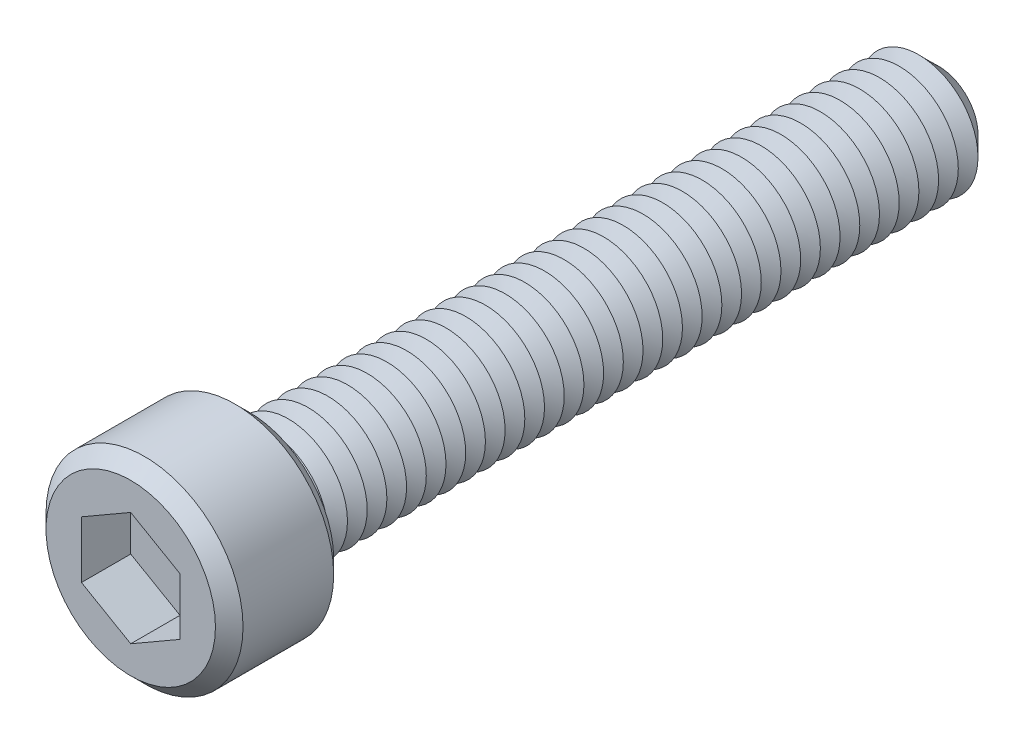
ISO-10303-21;
HEADER;
FILE_DESCRIPTION(('STEP AP214'),'2;1');
FILE_NAME('part.step','',(''),(''),'','','');
FILE_SCHEMA(('AUTOMOTIVE_DESIGN { 1 0 10303 214 1 1 1 1 }'));
ENDSEC;
DATA;
#1=APPLICATION_CONTEXT('core data for automotive mechanical design processes');
#2=APPLICATION_PROTOCOL_DEFINITION('international standard','automotive_design',2000,#1);
#3=PRODUCT_CONTEXT('',#1,'mechanical');
#4=PRODUCT('Part','Part','',(#3));
#5=PRODUCT_RELATED_PRODUCT_CATEGORY('part','',(#4));
#6=PRODUCT_DEFINITION_FORMATION('','',#4);
#7=PRODUCT_DEFINITION_CONTEXT('part definition',#1,'design');
#8=PRODUCT_DEFINITION('design','',#6,#7);
#9=PRODUCT_DEFINITION_SHAPE('','',#8);
#10=(LENGTH_UNIT() NAMED_UNIT(*) SI_UNIT(.MILLI.,.METRE.));
#11=(NAMED_UNIT(*) PLANE_ANGLE_UNIT() SI_UNIT($,.RADIAN.));
#12=(NAMED_UNIT(*) SI_UNIT($,.STERADIAN.) SOLID_ANGLE_UNIT());
#13=UNCERTAINTY_MEASURE_WITH_UNIT(LENGTH_MEASURE(1.E-05),#10,'distance_accuracy_value','');
#14=(GEOMETRIC_REPRESENTATION_CONTEXT(3) GLOBAL_UNCERTAINTY_ASSIGNED_CONTEXT((#13)) GLOBAL_UNIT_ASSIGNED_CONTEXT((#10,
#11,#12)) REPRESENTATION_CONTEXT('',''));
#15=CARTESIAN_POINT('',(0.,0.,0.));
#16=DIRECTION('',(0.,0.,1.));
#17=DIRECTION('',(1.,0.,0.));
#18=AXIS2_PLACEMENT_3D('',#15,#16,#17);
#19=CARTESIAN_POINT('',(0.,0.,6.));
#20=DIRECTION('',(0.,0.,-1.));
#21=DIRECTION('',(-1.,0.,0.));
#22=AXIS2_PLACEMENT_3D('',#19,#20,#21);
#23=CYLINDRICAL_SURFACE('',#22,5.);
#24=CARTESIAN_POINT('',(0.,0.,0.700000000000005));
#25=DIRECTION('',(0.,0.,1.));
#26=DIRECTION('',(1.,0.,0.));
#27=AXIS2_PLACEMENT_3D('',#24,#25,#26);
#28=CIRCLE('',#27,5.);
#29=CARTESIAN_POINT('',(5.,0.,0.700000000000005));
#30=VERTEX_POINT('',#29);
#31=EDGE_CURVE('E449',#30,#30,#28,.T.);
#32=ORIENTED_EDGE('',*,*,#31,.T.);
#33=EDGE_LOOP('',(#32));
#34=FACE_BOUND('',#33,.T.);
#35=CARTESIAN_POINT('',(0.,0.,5.3));
#36=DIRECTION('',(0.,0.,1.));
#37=DIRECTION('',(1.,0.,0.));
#38=AXIS2_PLACEMENT_3D('',#35,#36,#37);
#39=CIRCLE('',#38,5.);
#40=CARTESIAN_POINT('',(5.,0.,5.3));
#41=VERTEX_POINT('',#40);
#42=EDGE_CURVE('E445',#41,#41,#39,.F.);
#43=ORIENTED_EDGE('',*,*,#42,.T.);
#44=EDGE_LOOP('',(#43));
#45=FACE_BOUND('',#44,.T.);
#46=ADVANCED_FACE('F39',(#34,#45),#23,.T.);
#47=CARTESIAN_POINT('',(0.,0.,6.));
#48=DIRECTION('',(0.,0.,1.));
#49=DIRECTION('',(1.,0.,0.));
#50=AXIS2_PLACEMENT_3D('',#47,#48,#49);
#51=PLANE('',#50);
#52=CARTESIAN_POINT('',(0.,0.,6.));
#53=DIRECTION('',(0.,0.,1.));
#54=DIRECTION('',(1.,0.,0.));
#55=AXIS2_PLACEMENT_3D('',#52,#53,#54);
#56=CIRCLE('',#55,4.3);
#57=CARTESIAN_POINT('',(4.3,0.,6.));
#58=VERTEX_POINT('',#57);
#59=EDGE_CURVE('E11',#58,#58,#56,.T.);
#60=ORIENTED_EDGE('',*,*,#59,.T.);
#61=EDGE_LOOP('',(#60));
#62=FACE_BOUND('',#61,.T.);
#63=DIRECTION('',(-0.866025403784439,0.5,0.));
#64=VECTOR('',#63,1.);
#65=CARTESIAN_POINT('',(2.5,1.44337567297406,6.));
#66=LINE('',#65,#64);
#67=CARTESIAN_POINT('',(2.5,1.44337567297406,6.));
#68=VERTEX_POINT('',#67);
#69=CARTESIAN_POINT('',(0.,2.88675134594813,6.));
#70=VERTEX_POINT('',#69);
#71=EDGE_CURVE('E55',#68,#70,#66,.T.);
#72=ORIENTED_EDGE('',*,*,#71,.F.);
#73=DIRECTION('',(0.,1.,0.));
#74=VECTOR('',#73,1.);
#75=CARTESIAN_POINT('',(2.5,-1.44337567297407,6.));
#76=LINE('',#75,#74);
#77=CARTESIAN_POINT('',(2.5,-1.44337567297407,6.));
#78=VERTEX_POINT('',#77);
#79=EDGE_CURVE('E151',#78,#68,#76,.T.);
#80=ORIENTED_EDGE('',*,*,#79,.F.);
#81=DIRECTION('',(0.866025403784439,0.5,0.));
#82=VECTOR('',#81,1.);
#83=CARTESIAN_POINT('',(0.,-2.88675134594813,6.));
#84=LINE('',#83,#82);
#85=CARTESIAN_POINT('',(0.,-2.88675134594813,6.));
#86=VERTEX_POINT('',#85);
#87=EDGE_CURVE('E148',#86,#78,#84,.T.);
#88=ORIENTED_EDGE('',*,*,#87,.F.);
#89=DIRECTION('',(0.866025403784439,-0.5,0.));
#90=VECTOR('',#89,1.);
#91=CARTESIAN_POINT('',(-2.5,-1.44337567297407,6.));
#92=LINE('',#91,#90);
#93=CARTESIAN_POINT('',(-2.5,-1.44337567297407,6.));
#94=VERTEX_POINT('',#93);
#95=EDGE_CURVE('E103',#94,#86,#92,.T.);
#96=ORIENTED_EDGE('',*,*,#95,.F.);
#97=DIRECTION('',(0.,-1.,0.));
#98=VECTOR('',#97,1.);
#99=CARTESIAN_POINT('',(-2.5,1.44337567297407,6.));
#100=LINE('',#99,#98);
#101=CARTESIAN_POINT('',(-2.5,1.44337567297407,6.));
#102=VERTEX_POINT('',#101);
#103=EDGE_CURVE('E142',#102,#94,#100,.T.);
#104=ORIENTED_EDGE('',*,*,#103,.F.);
#105=DIRECTION('',(-0.866025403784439,-0.5,0.));
#106=VECTOR('',#105,1.);
#107=CARTESIAN_POINT('',(0.,2.88675134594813,6.));
#108=LINE('',#107,#106);
#109=EDGE_CURVE('E137',#70,#102,#108,.T.);
#110=ORIENTED_EDGE('',*,*,#109,.F.);
#111=EDGE_LOOP('',(#72,#80,#88,#96,#104,#110));
#112=FACE_BOUND('',#111,.T.);
#113=ADVANCED_FACE('F466',(#62,#112),#51,.T.);
#114=CARTESIAN_POINT('',(0.,0.,0.));
#115=DIRECTION('',(0.,0.,1.));
#116=DIRECTION('',(1.,0.,0.));
#117=AXIS2_PLACEMENT_3D('',#114,#115,#116);
#118=PLANE('',#117);
#119=CARTESIAN_POINT('',(0.,0.,0.));
#120=DIRECTION('',(0.,0.,1.));
#121=DIRECTION('',(1.,0.,0.));
#122=AXIS2_PLACEMENT_3D('',#119,#120,#121);
#123=CIRCLE('',#122,4.29999999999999);
#124=CARTESIAN_POINT('',(4.29999999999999,0.,0.));
#125=VERTEX_POINT('',#124);
#126=EDGE_CURVE('E48',#125,#125,#123,.F.);
#127=ORIENTED_EDGE('',*,*,#126,.T.);
#128=EDGE_LOOP('',(#127));
#129=FACE_BOUND('',#128,.T.);
#130=CARTESIAN_POINT('',(0.,0.,0.));
#131=DIRECTION('',(0.,0.,1.));
#132=DIRECTION('',(1.,0.,0.));
#133=AXIS2_PLACEMENT_3D('',#130,#131,#132);
#134=CIRCLE('',#133,3.);
#135=CARTESIAN_POINT('',(3.,0.,0.));
#136=VERTEX_POINT('',#135);
#137=EDGE_CURVE('E437',#136,#136,#134,.T.);
#138=ORIENTED_EDGE('',*,*,#137,.T.);
#139=EDGE_LOOP('',(#138));
#140=FACE_BOUND('',#139,.T.);
#141=ADVANCED_FACE('F455',(#129,#140),#118,.F.);
#142=CARTESIAN_POINT('',(0.,0.,0.));
#143=DIRECTION('',(0.,0.,1.));
#144=DIRECTION('',(1.,0.,0.));
#145=AXIS2_PLACEMENT_3D('',#142,#143,#144);
#146=CONICAL_SURFACE('',#145,3.,1.0471975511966);
#147=CARTESIAN_POINT('',(0.,0.,-0.500000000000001));
#148=DIRECTION('',(0.,0.,1.));
#149=DIRECTION('',(1.,0.,0.));
#150=AXIS2_PLACEMENT_3D('',#147,#148,#149);
#151=CIRCLE('',#150,2.13397459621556);
#152=CARTESIAN_POINT('',(2.13397459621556,0.,-0.500000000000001));
#153=VERTEX_POINT('',#152);
#154=EDGE_CURVE('E433',#153,#153,#151,.T.);
#155=ORIENTED_EDGE('',*,*,#154,.T.);
#156=EDGE_LOOP('',(#155));
#157=FACE_BOUND('',#156,.T.);
#158=ORIENTED_EDGE('',*,*,#137,.F.);
#159=EDGE_LOOP('',(#158));
#160=FACE_BOUND('',#159,.T.);
#161=ADVANCED_FACE('F788',(#157,#160),#146,.T.);
#162=CARTESIAN_POINT('',(0.,0.,-0.500000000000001));
#163=DIRECTION('',(0.,0.,-1.));
#164=DIRECTION('',(-1.,0.,0.));
#165=AXIS2_PLACEMENT_3D('',#162,#163,#164);
#166=CONICAL_SURFACE('',#165,2.13397459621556,1.0471975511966);
#167=CARTESIAN_POINT('',(0.,0.,-1.));
#168=DIRECTION('',(0.,0.,1.));
#169=DIRECTION('',(1.,0.,0.));
#170=AXIS2_PLACEMENT_3D('',#167,#168,#169);
#171=CIRCLE('',#170,3.);
#172=CARTESIAN_POINT('',(3.,0.,-1.));
#173=VERTEX_POINT('',#172);
#174=EDGE_CURVE('E429',#173,#173,#171,.T.);
#175=ORIENTED_EDGE('',*,*,#174,.T.);
#176=EDGE_LOOP('',(#175));
#177=FACE_BOUND('',#176,.T.);
#178=ORIENTED_EDGE('',*,*,#154,.F.);
#179=EDGE_LOOP('',(#178));
#180=FACE_BOUND('',#179,.T.);
#181=ADVANCED_FACE('F784',(#177,#180),#166,.T.);
#182=CARTESIAN_POINT('',(0.,0.,-1.));
#183=DIRECTION('',(0.,0.,1.));
#184=DIRECTION('',(1.,0.,0.));
#185=AXIS2_PLACEMENT_3D('',#182,#183,#184);
#186=CONICAL_SURFACE('',#185,3.,1.0471975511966);
#187=CARTESIAN_POINT('',(0.,0.,-1.5));
#188=DIRECTION('',(0.,0.,1.));
#189=DIRECTION('',(1.,0.,0.));
#190=AXIS2_PLACEMENT_3D('',#187,#188,#189);
#191=CIRCLE('',#190,2.13397459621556);
#192=CARTESIAN_POINT('',(2.13397459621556,0.,-1.5));
#193=VERTEX_POINT('',#192);
#194=EDGE_CURVE('E425',#193,#193,#191,.T.);
#195=ORIENTED_EDGE('',*,*,#194,.T.);
#196=EDGE_LOOP('',(#195));
#197=FACE_BOUND('',#196,.T.);
#198=ORIENTED_EDGE('',*,*,#174,.F.);
#199=EDGE_LOOP('',(#198));
#200=FACE_BOUND('',#199,.T.);
#201=ADVANCED_FACE('F780',(#197,#200),#186,.T.);
#202=CARTESIAN_POINT('',(0.,0.,-1.5));
#203=DIRECTION('',(0.,0.,-1.));
#204=DIRECTION('',(-1.,0.,0.));
#205=AXIS2_PLACEMENT_3D('',#202,#203,#204);
#206=CONICAL_SURFACE('',#205,2.13397459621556,1.0471975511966);
#207=CARTESIAN_POINT('',(0.,0.,-2.));
#208=DIRECTION('',(0.,0.,1.));
#209=DIRECTION('',(1.,0.,0.));
#210=AXIS2_PLACEMENT_3D('',#207,#208,#209);
#211=CIRCLE('',#210,3.);
#212=CARTESIAN_POINT('',(3.,0.,-2.));
#213=VERTEX_POINT('',#212);
#214=EDGE_CURVE('E421',#213,#213,#211,.T.);
#215=ORIENTED_EDGE('',*,*,#214,.T.);
#216=EDGE_LOOP('',(#215));
#217=FACE_BOUND('',#216,.T.);
#218=ORIENTED_EDGE('',*,*,#194,.F.);
#219=EDGE_LOOP('',(#218));
#220=FACE_BOUND('',#219,.T.);
#221=ADVANCED_FACE('F776',(#217,#220),#206,.T.);
#222=CARTESIAN_POINT('',(0.,0.,-2.));
#223=DIRECTION('',(0.,0.,1.));
#224=DIRECTION('',(1.,0.,0.));
#225=AXIS2_PLACEMENT_3D('',#222,#223,#224);
#226=CONICAL_SURFACE('',#225,3.,1.0471975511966);
#227=CARTESIAN_POINT('',(0.,0.,-2.5));
#228=DIRECTION('',(0.,0.,1.));
#229=DIRECTION('',(1.,0.,0.));
#230=AXIS2_PLACEMENT_3D('',#227,#228,#229);
#231=CIRCLE('',#230,2.13397459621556);
#232=CARTESIAN_POINT('',(2.13397459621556,0.,-2.5));
#233=VERTEX_POINT('',#232);
#234=EDGE_CURVE('E417',#233,#233,#231,.T.);
#235=ORIENTED_EDGE('',*,*,#234,.T.);
#236=EDGE_LOOP('',(#235));
#237=FACE_BOUND('',#236,.T.);
#238=ORIENTED_EDGE('',*,*,#214,.F.);
#239=EDGE_LOOP('',(#238));
#240=FACE_BOUND('',#239,.T.);
#241=ADVANCED_FACE('F772',(#237,#240),#226,.T.);
#242=CARTESIAN_POINT('',(0.,0.,-2.5));
#243=DIRECTION('',(0.,0.,-1.));
#244=DIRECTION('',(-1.,0.,0.));
#245=AXIS2_PLACEMENT_3D('',#242,#243,#244);
#246=CONICAL_SURFACE('',#245,2.13397459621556,1.0471975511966);
#247=CARTESIAN_POINT('',(0.,0.,-3.));
#248=DIRECTION('',(0.,0.,1.));
#249=DIRECTION('',(1.,0.,0.));
#250=AXIS2_PLACEMENT_3D('',#247,#248,#249);
#251=CIRCLE('',#250,3.);
#252=CARTESIAN_POINT('',(3.,0.,-3.));
#253=VERTEX_POINT('',#252);
#254=EDGE_CURVE('E413',#253,#253,#251,.T.);
#255=ORIENTED_EDGE('',*,*,#254,.T.);
#256=EDGE_LOOP('',(#255));
#257=FACE_BOUND('',#256,.T.);
#258=ORIENTED_EDGE('',*,*,#234,.F.);
#259=EDGE_LOOP('',(#258));
#260=FACE_BOUND('',#259,.T.);
#261=ADVANCED_FACE('F768',(#257,#260),#246,.T.);
#262=CARTESIAN_POINT('',(0.,0.,-3.));
#263=DIRECTION('',(0.,0.,1.));
#264=DIRECTION('',(1.,0.,0.));
#265=AXIS2_PLACEMENT_3D('',#262,#263,#264);
#266=CONICAL_SURFACE('',#265,3.,1.0471975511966);
#267=CARTESIAN_POINT('',(0.,0.,-3.5));
#268=DIRECTION('',(0.,0.,1.));
#269=DIRECTION('',(1.,0.,0.));
#270=AXIS2_PLACEMENT_3D('',#267,#268,#269);
#271=CIRCLE('',#270,2.13397459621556);
#272=CARTESIAN_POINT('',(2.13397459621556,0.,-3.5));
#273=VERTEX_POINT('',#272);
#274=EDGE_CURVE('E409',#273,#273,#271,.T.);
#275=ORIENTED_EDGE('',*,*,#274,.T.);
#276=EDGE_LOOP('',(#275));
#277=FACE_BOUND('',#276,.T.);
#278=ORIENTED_EDGE('',*,*,#254,.F.);
#279=EDGE_LOOP('',(#278));
#280=FACE_BOUND('',#279,.T.);
#281=ADVANCED_FACE('F764',(#277,#280),#266,.T.);
#282=CARTESIAN_POINT('',(0.,0.,-3.5));
#283=DIRECTION('',(0.,0.,-1.));
#284=DIRECTION('',(-1.,0.,0.));
#285=AXIS2_PLACEMENT_3D('',#282,#283,#284);
#286=CONICAL_SURFACE('',#285,2.13397459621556,1.0471975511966);
#287=CARTESIAN_POINT('',(0.,0.,-4.));
#288=DIRECTION('',(0.,0.,1.));
#289=DIRECTION('',(1.,0.,0.));
#290=AXIS2_PLACEMENT_3D('',#287,#288,#289);
#291=CIRCLE('',#290,3.);
#292=CARTESIAN_POINT('',(3.,0.,-4.));
#293=VERTEX_POINT('',#292);
#294=EDGE_CURVE('E405',#293,#293,#291,.T.);
#295=ORIENTED_EDGE('',*,*,#294,.T.);
#296=EDGE_LOOP('',(#295));
#297=FACE_BOUND('',#296,.T.);
#298=ORIENTED_EDGE('',*,*,#274,.F.);
#299=EDGE_LOOP('',(#298));
#300=FACE_BOUND('',#299,.T.);
#301=ADVANCED_FACE('F760',(#297,#300),#286,.T.);
#302=CARTESIAN_POINT('',(0.,0.,-4.));
#303=DIRECTION('',(0.,0.,1.));
#304=DIRECTION('',(1.,0.,0.));
#305=AXIS2_PLACEMENT_3D('',#302,#303,#304);
#306=CONICAL_SURFACE('',#305,3.,1.0471975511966);
#307=CARTESIAN_POINT('',(0.,0.,-4.5));
#308=DIRECTION('',(0.,0.,1.));
#309=DIRECTION('',(1.,0.,0.));
#310=AXIS2_PLACEMENT_3D('',#307,#308,#309);
#311=CIRCLE('',#310,2.13397459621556);
#312=CARTESIAN_POINT('',(2.13397459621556,0.,-4.5));
#313=VERTEX_POINT('',#312);
#314=EDGE_CURVE('E401',#313,#313,#311,.T.);
#315=ORIENTED_EDGE('',*,*,#314,.T.);
#316=EDGE_LOOP('',(#315));
#317=FACE_BOUND('',#316,.T.);
#318=ORIENTED_EDGE('',*,*,#294,.F.);
#319=EDGE_LOOP('',(#318));
#320=FACE_BOUND('',#319,.T.);
#321=ADVANCED_FACE('F756',(#317,#320),#306,.T.);
#322=CARTESIAN_POINT('',(0.,0.,-4.5));
#323=DIRECTION('',(0.,0.,-1.));
#324=DIRECTION('',(-1.,0.,0.));
#325=AXIS2_PLACEMENT_3D('',#322,#323,#324);
#326=CONICAL_SURFACE('',#325,2.13397459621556,1.0471975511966);
#327=CARTESIAN_POINT('',(0.,0.,-5.));
#328=DIRECTION('',(0.,0.,1.));
#329=DIRECTION('',(1.,0.,0.));
#330=AXIS2_PLACEMENT_3D('',#327,#328,#329);
#331=CIRCLE('',#330,3.);
#332=CARTESIAN_POINT('',(3.,0.,-5.));
#333=VERTEX_POINT('',#332);
#334=EDGE_CURVE('E397',#333,#333,#331,.T.);
#335=ORIENTED_EDGE('',*,*,#334,.T.);
#336=EDGE_LOOP('',(#335));
#337=FACE_BOUND('',#336,.T.);
#338=ORIENTED_EDGE('',*,*,#314,.F.);
#339=EDGE_LOOP('',(#338));
#340=FACE_BOUND('',#339,.T.);
#341=ADVANCED_FACE('F752',(#337,#340),#326,.T.);
#342=CARTESIAN_POINT('',(0.,0.,-5.));
#343=DIRECTION('',(0.,0.,1.));
#344=DIRECTION('',(1.,0.,0.));
#345=AXIS2_PLACEMENT_3D('',#342,#343,#344);
#346=CONICAL_SURFACE('',#345,3.,1.0471975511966);
#347=CARTESIAN_POINT('',(0.,0.,-5.5));
#348=DIRECTION('',(0.,0.,1.));
#349=DIRECTION('',(1.,0.,0.));
#350=AXIS2_PLACEMENT_3D('',#347,#348,#349);
#351=CIRCLE('',#350,2.13397459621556);
#352=CARTESIAN_POINT('',(2.13397459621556,0.,-5.5));
#353=VERTEX_POINT('',#352);
#354=EDGE_CURVE('E393',#353,#353,#351,.T.);
#355=ORIENTED_EDGE('',*,*,#354,.T.);
#356=EDGE_LOOP('',(#355));
#357=FACE_BOUND('',#356,.T.);
#358=ORIENTED_EDGE('',*,*,#334,.F.);
#359=EDGE_LOOP('',(#358));
#360=FACE_BOUND('',#359,.T.);
#361=ADVANCED_FACE('F748',(#357,#360),#346,.T.);
#362=CARTESIAN_POINT('',(0.,0.,-5.5));
#363=DIRECTION('',(0.,0.,-1.));
#364=DIRECTION('',(-1.,0.,0.));
#365=AXIS2_PLACEMENT_3D('',#362,#363,#364);
#366=CONICAL_SURFACE('',#365,2.13397459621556,1.0471975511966);
#367=CARTESIAN_POINT('',(0.,0.,-6.));
#368=DIRECTION('',(0.,0.,1.));
#369=DIRECTION('',(1.,0.,0.));
#370=AXIS2_PLACEMENT_3D('',#367,#368,#369);
#371=CIRCLE('',#370,3.);
#372=CARTESIAN_POINT('',(3.,0.,-6.));
#373=VERTEX_POINT('',#372);
#374=EDGE_CURVE('E389',#373,#373,#371,.T.);
#375=ORIENTED_EDGE('',*,*,#374,.T.);
#376=EDGE_LOOP('',(#375));
#377=FACE_BOUND('',#376,.T.);
#378=ORIENTED_EDGE('',*,*,#354,.F.);
#379=EDGE_LOOP('',(#378));
#380=FACE_BOUND('',#379,.T.);
#381=ADVANCED_FACE('F744',(#377,#380),#366,.T.);
#382=CARTESIAN_POINT('',(0.,0.,-6.));
#383=DIRECTION('',(0.,0.,1.));
#384=DIRECTION('',(1.,0.,0.));
#385=AXIS2_PLACEMENT_3D('',#382,#383,#384);
#386=CONICAL_SURFACE('',#385,3.,1.0471975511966);
#387=CARTESIAN_POINT('',(0.,0.,-6.5));
#388=DIRECTION('',(0.,0.,1.));
#389=DIRECTION('',(1.,0.,0.));
#390=AXIS2_PLACEMENT_3D('',#387,#388,#389);
#391=CIRCLE('',#390,2.13397459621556);
#392=CARTESIAN_POINT('',(2.13397459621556,0.,-6.5));
#393=VERTEX_POINT('',#392);
#394=EDGE_CURVE('E385',#393,#393,#391,.T.);
#395=ORIENTED_EDGE('',*,*,#394,.T.);
#396=EDGE_LOOP('',(#395));
#397=FACE_BOUND('',#396,.T.);
#398=ORIENTED_EDGE('',*,*,#374,.F.);
#399=EDGE_LOOP('',(#398));
#400=FACE_BOUND('',#399,.T.);
#401=ADVANCED_FACE('F740',(#397,#400),#386,.T.);
#402=CARTESIAN_POINT('',(0.,0.,-6.5));
#403=DIRECTION('',(0.,0.,-1.));
#404=DIRECTION('',(-1.,0.,0.));
#405=AXIS2_PLACEMENT_3D('',#402,#403,#404);
#406=CONICAL_SURFACE('',#405,2.13397459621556,1.0471975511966);
#407=CARTESIAN_POINT('',(0.,0.,-7.));
#408=DIRECTION('',(0.,0.,1.));
#409=DIRECTION('',(1.,0.,0.));
#410=AXIS2_PLACEMENT_3D('',#407,#408,#409);
#411=CIRCLE('',#410,3.);
#412=CARTESIAN_POINT('',(3.,0.,-7.));
#413=VERTEX_POINT('',#412);
#414=EDGE_CURVE('E381',#413,#413,#411,.T.);
#415=ORIENTED_EDGE('',*,*,#414,.T.);
#416=EDGE_LOOP('',(#415));
#417=FACE_BOUND('',#416,.T.);
#418=ORIENTED_EDGE('',*,*,#394,.F.);
#419=EDGE_LOOP('',(#418));
#420=FACE_BOUND('',#419,.T.);
#421=ADVANCED_FACE('F736',(#417,#420),#406,.T.);
#422=CARTESIAN_POINT('',(0.,0.,-7.));
#423=DIRECTION('',(0.,0.,1.));
#424=DIRECTION('',(1.,0.,0.));
#425=AXIS2_PLACEMENT_3D('',#422,#423,#424);
#426=CONICAL_SURFACE('',#425,3.,1.0471975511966);
#427=CARTESIAN_POINT('',(0.,0.,-7.5));
#428=DIRECTION('',(0.,0.,1.));
#429=DIRECTION('',(1.,0.,0.));
#430=AXIS2_PLACEMENT_3D('',#427,#428,#429);
#431=CIRCLE('',#430,2.13397459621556);
#432=CARTESIAN_POINT('',(2.13397459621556,0.,-7.5));
#433=VERTEX_POINT('',#432);
#434=EDGE_CURVE('E377',#433,#433,#431,.T.);
#435=ORIENTED_EDGE('',*,*,#434,.T.);
#436=EDGE_LOOP('',(#435));
#437=FACE_BOUND('',#436,.T.);
#438=ORIENTED_EDGE('',*,*,#414,.F.);
#439=EDGE_LOOP('',(#438));
#440=FACE_BOUND('',#439,.T.);
#441=ADVANCED_FACE('F732',(#437,#440),#426,.T.);
#442=CARTESIAN_POINT('',(0.,0.,-7.5));
#443=DIRECTION('',(0.,0.,-1.));
#444=DIRECTION('',(-1.,0.,0.));
#445=AXIS2_PLACEMENT_3D('',#442,#443,#444);
#446=CONICAL_SURFACE('',#445,2.13397459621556,1.0471975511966);
#447=CARTESIAN_POINT('',(0.,0.,-8.));
#448=DIRECTION('',(0.,0.,1.));
#449=DIRECTION('',(1.,0.,0.));
#450=AXIS2_PLACEMENT_3D('',#447,#448,#449);
#451=CIRCLE('',#450,3.);
#452=CARTESIAN_POINT('',(3.,0.,-8.));
#453=VERTEX_POINT('',#452);
#454=EDGE_CURVE('E373',#453,#453,#451,.T.);
#455=ORIENTED_EDGE('',*,*,#454,.T.);
#456=EDGE_LOOP('',(#455));
#457=FACE_BOUND('',#456,.T.);
#458=ORIENTED_EDGE('',*,*,#434,.F.);
#459=EDGE_LOOP('',(#458));
#460=FACE_BOUND('',#459,.T.);
#461=ADVANCED_FACE('F728',(#457,#460),#446,.T.);
#462=CARTESIAN_POINT('',(0.,0.,-8.));
#463=DIRECTION('',(0.,0.,1.));
#464=DIRECTION('',(1.,0.,0.));
#465=AXIS2_PLACEMENT_3D('',#462,#463,#464);
#466=CONICAL_SURFACE('',#465,3.,1.0471975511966);
#467=CARTESIAN_POINT('',(0.,0.,-8.5));
#468=DIRECTION('',(0.,0.,1.));
#469=DIRECTION('',(1.,0.,0.));
#470=AXIS2_PLACEMENT_3D('',#467,#468,#469);
#471=CIRCLE('',#470,2.13397459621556);
#472=CARTESIAN_POINT('',(2.13397459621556,0.,-8.5));
#473=VERTEX_POINT('',#472);
#474=EDGE_CURVE('E369',#473,#473,#471,.T.);
#475=ORIENTED_EDGE('',*,*,#474,.T.);
#476=EDGE_LOOP('',(#475));
#477=FACE_BOUND('',#476,.T.);
#478=ORIENTED_EDGE('',*,*,#454,.F.);
#479=EDGE_LOOP('',(#478));
#480=FACE_BOUND('',#479,.T.);
#481=ADVANCED_FACE('F724',(#477,#480),#466,.T.);
#482=CARTESIAN_POINT('',(0.,0.,-8.5));
#483=DIRECTION('',(0.,0.,-1.));
#484=DIRECTION('',(-1.,0.,0.));
#485=AXIS2_PLACEMENT_3D('',#482,#483,#484);
#486=CONICAL_SURFACE('',#485,2.13397459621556,1.0471975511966);
#487=CARTESIAN_POINT('',(0.,0.,-9.));
#488=DIRECTION('',(0.,0.,1.));
#489=DIRECTION('',(1.,0.,0.));
#490=AXIS2_PLACEMENT_3D('',#487,#488,#489);
#491=CIRCLE('',#490,3.);
#492=CARTESIAN_POINT('',(3.,0.,-9.));
#493=VERTEX_POINT('',#492);
#494=EDGE_CURVE('E365',#493,#493,#491,.T.);
#495=ORIENTED_EDGE('',*,*,#494,.T.);
#496=EDGE_LOOP('',(#495));
#497=FACE_BOUND('',#496,.T.);
#498=ORIENTED_EDGE('',*,*,#474,.F.);
#499=EDGE_LOOP('',(#498));
#500=FACE_BOUND('',#499,.T.);
#501=ADVANCED_FACE('F720',(#497,#500),#486,.T.);
#502=CARTESIAN_POINT('',(0.,0.,-9.));
#503=DIRECTION('',(0.,0.,1.));
#504=DIRECTION('',(1.,0.,0.));
#505=AXIS2_PLACEMENT_3D('',#502,#503,#504);
#506=CONICAL_SURFACE('',#505,3.,1.0471975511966);
#507=CARTESIAN_POINT('',(0.,0.,-9.5));
#508=DIRECTION('',(0.,0.,1.));
#509=DIRECTION('',(1.,0.,0.));
#510=AXIS2_PLACEMENT_3D('',#507,#508,#509);
#511=CIRCLE('',#510,2.13397459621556);
#512=CARTESIAN_POINT('',(2.13397459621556,0.,-9.5));
#513=VERTEX_POINT('',#512);
#514=EDGE_CURVE('E361',#513,#513,#511,.T.);
#515=ORIENTED_EDGE('',*,*,#514,.T.);
#516=EDGE_LOOP('',(#515));
#517=FACE_BOUND('',#516,.T.);
#518=ORIENTED_EDGE('',*,*,#494,.F.);
#519=EDGE_LOOP('',(#518));
#520=FACE_BOUND('',#519,.T.);
#521=ADVANCED_FACE('F716',(#517,#520),#506,.T.);
#522=CARTESIAN_POINT('',(0.,0.,-9.5));
#523=DIRECTION('',(0.,0.,-1.));
#524=DIRECTION('',(-1.,0.,0.));
#525=AXIS2_PLACEMENT_3D('',#522,#523,#524);
#526=CONICAL_SURFACE('',#525,2.13397459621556,1.0471975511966);
#527=CARTESIAN_POINT('',(0.,0.,-10.));
#528=DIRECTION('',(0.,0.,1.));
#529=DIRECTION('',(1.,0.,0.));
#530=AXIS2_PLACEMENT_3D('',#527,#528,#529);
#531=CIRCLE('',#530,3.);
#532=CARTESIAN_POINT('',(3.,0.,-10.));
#533=VERTEX_POINT('',#532);
#534=EDGE_CURVE('E357',#533,#533,#531,.T.);
#535=ORIENTED_EDGE('',*,*,#534,.T.);
#536=EDGE_LOOP('',(#535));
#537=FACE_BOUND('',#536,.T.);
#538=ORIENTED_EDGE('',*,*,#514,.F.);
#539=EDGE_LOOP('',(#538));
#540=FACE_BOUND('',#539,.T.);
#541=ADVANCED_FACE('F712',(#537,#540),#526,.T.);
#542=CARTESIAN_POINT('',(0.,0.,-10.));
#543=DIRECTION('',(0.,0.,1.));
#544=DIRECTION('',(1.,0.,0.));
#545=AXIS2_PLACEMENT_3D('',#542,#543,#544);
#546=CONICAL_SURFACE('',#545,3.,1.0471975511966);
#547=CARTESIAN_POINT('',(0.,0.,-10.5));
#548=DIRECTION('',(0.,0.,1.));
#549=DIRECTION('',(1.,0.,0.));
#550=AXIS2_PLACEMENT_3D('',#547,#548,#549);
#551=CIRCLE('',#550,2.13397459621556);
#552=CARTESIAN_POINT('',(2.13397459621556,0.,-10.5));
#553=VERTEX_POINT('',#552);
#554=EDGE_CURVE('E353',#553,#553,#551,.T.);
#555=ORIENTED_EDGE('',*,*,#554,.T.);
#556=EDGE_LOOP('',(#555));
#557=FACE_BOUND('',#556,.T.);
#558=ORIENTED_EDGE('',*,*,#534,.F.);
#559=EDGE_LOOP('',(#558));
#560=FACE_BOUND('',#559,.T.);
#561=ADVANCED_FACE('F708',(#557,#560),#546,.T.);
#562=CARTESIAN_POINT('',(0.,0.,-10.5));
#563=DIRECTION('',(0.,0.,-1.));
#564=DIRECTION('',(-1.,0.,0.));
#565=AXIS2_PLACEMENT_3D('',#562,#563,#564);
#566=CONICAL_SURFACE('',#565,2.13397459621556,1.0471975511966);
#567=CARTESIAN_POINT('',(0.,0.,-11.));
#568=DIRECTION('',(0.,0.,1.));
#569=DIRECTION('',(1.,0.,0.));
#570=AXIS2_PLACEMENT_3D('',#567,#568,#569);
#571=CIRCLE('',#570,3.);
#572=CARTESIAN_POINT('',(3.,0.,-11.));
#573=VERTEX_POINT('',#572);
#574=EDGE_CURVE('E349',#573,#573,#571,.T.);
#575=ORIENTED_EDGE('',*,*,#574,.T.);
#576=EDGE_LOOP('',(#575));
#577=FACE_BOUND('',#576,.T.);
#578=ORIENTED_EDGE('',*,*,#554,.F.);
#579=EDGE_LOOP('',(#578));
#580=FACE_BOUND('',#579,.T.);
#581=ADVANCED_FACE('F704',(#577,#580),#566,.T.);
#582=CARTESIAN_POINT('',(0.,0.,-11.));
#583=DIRECTION('',(0.,0.,1.));
#584=DIRECTION('',(1.,0.,0.));
#585=AXIS2_PLACEMENT_3D('',#582,#583,#584);
#586=CONICAL_SURFACE('',#585,3.,1.0471975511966);
#587=CARTESIAN_POINT('',(0.,0.,-11.5));
#588=DIRECTION('',(0.,0.,1.));
#589=DIRECTION('',(1.,0.,0.));
#590=AXIS2_PLACEMENT_3D('',#587,#588,#589);
#591=CIRCLE('',#590,2.13397459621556);
#592=CARTESIAN_POINT('',(2.13397459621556,0.,-11.5));
#593=VERTEX_POINT('',#592);
#594=EDGE_CURVE('E345',#593,#593,#591,.T.);
#595=ORIENTED_EDGE('',*,*,#594,.T.);
#596=EDGE_LOOP('',(#595));
#597=FACE_BOUND('',#596,.T.);
#598=ORIENTED_EDGE('',*,*,#574,.F.);
#599=EDGE_LOOP('',(#598));
#600=FACE_BOUND('',#599,.T.);
#601=ADVANCED_FACE('F700',(#597,#600),#586,.T.);
#602=CARTESIAN_POINT('',(0.,0.,-11.5));
#603=DIRECTION('',(0.,0.,-1.));
#604=DIRECTION('',(-1.,0.,0.));
#605=AXIS2_PLACEMENT_3D('',#602,#603,#604);
#606=CONICAL_SURFACE('',#605,2.13397459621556,1.0471975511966);
#607=CARTESIAN_POINT('',(0.,0.,-12.));
#608=DIRECTION('',(0.,0.,1.));
#609=DIRECTION('',(1.,0.,0.));
#610=AXIS2_PLACEMENT_3D('',#607,#608,#609);
#611=CIRCLE('',#610,3.);
#612=CARTESIAN_POINT('',(3.,0.,-12.));
#613=VERTEX_POINT('',#612);
#614=EDGE_CURVE('E341',#613,#613,#611,.T.);
#615=ORIENTED_EDGE('',*,*,#614,.T.);
#616=EDGE_LOOP('',(#615));
#617=FACE_BOUND('',#616,.T.);
#618=ORIENTED_EDGE('',*,*,#594,.F.);
#619=EDGE_LOOP('',(#618));
#620=FACE_BOUND('',#619,.T.);
#621=ADVANCED_FACE('F696',(#617,#620),#606,.T.);
#622=CARTESIAN_POINT('',(0.,0.,-12.));
#623=DIRECTION('',(0.,0.,1.));
#624=DIRECTION('',(1.,0.,0.));
#625=AXIS2_PLACEMENT_3D('',#622,#623,#624);
#626=CONICAL_SURFACE('',#625,3.,1.0471975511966);
#627=CARTESIAN_POINT('',(0.,0.,-12.5));
#628=DIRECTION('',(0.,0.,1.));
#629=DIRECTION('',(1.,0.,0.));
#630=AXIS2_PLACEMENT_3D('',#627,#628,#629);
#631=CIRCLE('',#630,2.13397459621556);
#632=CARTESIAN_POINT('',(2.13397459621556,0.,-12.5));
#633=VERTEX_POINT('',#632);
#634=EDGE_CURVE('E337',#633,#633,#631,.T.);
#635=ORIENTED_EDGE('',*,*,#634,.T.);
#636=EDGE_LOOP('',(#635));
#637=FACE_BOUND('',#636,.T.);
#638=ORIENTED_EDGE('',*,*,#614,.F.);
#639=EDGE_LOOP('',(#638));
#640=FACE_BOUND('',#639,.T.);
#641=ADVANCED_FACE('F692',(#637,#640),#626,.T.);
#642=CARTESIAN_POINT('',(0.,0.,-12.5));
#643=DIRECTION('',(0.,0.,-1.));
#644=DIRECTION('',(-1.,0.,0.));
#645=AXIS2_PLACEMENT_3D('',#642,#643,#644);
#646=CONICAL_SURFACE('',#645,2.13397459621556,1.0471975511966);
#647=CARTESIAN_POINT('',(0.,0.,-13.));
#648=DIRECTION('',(0.,0.,1.));
#649=DIRECTION('',(1.,0.,0.));
#650=AXIS2_PLACEMENT_3D('',#647,#648,#649);
#651=CIRCLE('',#650,3.);
#652=CARTESIAN_POINT('',(3.,0.,-13.));
#653=VERTEX_POINT('',#652);
#654=EDGE_CURVE('E333',#653,#653,#651,.T.);
#655=ORIENTED_EDGE('',*,*,#654,.T.);
#656=EDGE_LOOP('',(#655));
#657=FACE_BOUND('',#656,.T.);
#658=ORIENTED_EDGE('',*,*,#634,.F.);
#659=EDGE_LOOP('',(#658));
#660=FACE_BOUND('',#659,.T.);
#661=ADVANCED_FACE('F688',(#657,#660),#646,.T.);
#662=CARTESIAN_POINT('',(0.,0.,-13.));
#663=DIRECTION('',(0.,0.,1.));
#664=DIRECTION('',(1.,0.,0.));
#665=AXIS2_PLACEMENT_3D('',#662,#663,#664);
#666=CONICAL_SURFACE('',#665,3.,1.0471975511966);
#667=CARTESIAN_POINT('',(0.,0.,-13.5));
#668=DIRECTION('',(0.,0.,1.));
#669=DIRECTION('',(1.,0.,0.));
#670=AXIS2_PLACEMENT_3D('',#667,#668,#669);
#671=CIRCLE('',#670,2.13397459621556);
#672=CARTESIAN_POINT('',(2.13397459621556,0.,-13.5));
#673=VERTEX_POINT('',#672);
#674=EDGE_CURVE('E329',#673,#673,#671,.T.);
#675=ORIENTED_EDGE('',*,*,#674,.T.);
#676=EDGE_LOOP('',(#675));
#677=FACE_BOUND('',#676,.T.);
#678=ORIENTED_EDGE('',*,*,#654,.F.);
#679=EDGE_LOOP('',(#678));
#680=FACE_BOUND('',#679,.T.);
#681=ADVANCED_FACE('F684',(#677,#680),#666,.T.);
#682=CARTESIAN_POINT('',(0.,0.,-13.5));
#683=DIRECTION('',(0.,0.,-1.));
#684=DIRECTION('',(-1.,0.,0.));
#685=AXIS2_PLACEMENT_3D('',#682,#683,#684);
#686=CONICAL_SURFACE('',#685,2.13397459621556,1.0471975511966);
#687=CARTESIAN_POINT('',(0.,0.,-14.));
#688=DIRECTION('',(0.,0.,1.));
#689=DIRECTION('',(1.,0.,0.));
#690=AXIS2_PLACEMENT_3D('',#687,#688,#689);
#691=CIRCLE('',#690,3.);
#692=CARTESIAN_POINT('',(3.,0.,-14.));
#693=VERTEX_POINT('',#692);
#694=EDGE_CURVE('E325',#693,#693,#691,.T.);
#695=ORIENTED_EDGE('',*,*,#694,.T.);
#696=EDGE_LOOP('',(#695));
#697=FACE_BOUND('',#696,.T.);
#698=ORIENTED_EDGE('',*,*,#674,.F.);
#699=EDGE_LOOP('',(#698));
#700=FACE_BOUND('',#699,.T.);
#701=ADVANCED_FACE('F680',(#697,#700),#686,.T.);
#702=CARTESIAN_POINT('',(0.,0.,-14.));
#703=DIRECTION('',(0.,0.,1.));
#704=DIRECTION('',(1.,0.,0.));
#705=AXIS2_PLACEMENT_3D('',#702,#703,#704);
#706=CONICAL_SURFACE('',#705,3.,1.0471975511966);
#707=CARTESIAN_POINT('',(0.,0.,-14.5));
#708=DIRECTION('',(0.,0.,1.));
#709=DIRECTION('',(1.,0.,0.));
#710=AXIS2_PLACEMENT_3D('',#707,#708,#709);
#711=CIRCLE('',#710,2.13397459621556);
#712=CARTESIAN_POINT('',(2.13397459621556,0.,-14.5));
#713=VERTEX_POINT('',#712);
#714=EDGE_CURVE('E321',#713,#713,#711,.T.);
#715=ORIENTED_EDGE('',*,*,#714,.T.);
#716=EDGE_LOOP('',(#715));
#717=FACE_BOUND('',#716,.T.);
#718=ORIENTED_EDGE('',*,*,#694,.F.);
#719=EDGE_LOOP('',(#718));
#720=FACE_BOUND('',#719,.T.);
#721=ADVANCED_FACE('F676',(#717,#720),#706,.T.);
#722=CARTESIAN_POINT('',(0.,0.,-14.5));
#723=DIRECTION('',(0.,0.,-1.));
#724=DIRECTION('',(-1.,0.,0.));
#725=AXIS2_PLACEMENT_3D('',#722,#723,#724);
#726=CONICAL_SURFACE('',#725,2.13397459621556,1.0471975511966);
#727=CARTESIAN_POINT('',(0.,0.,-15.));
#728=DIRECTION('',(0.,0.,1.));
#729=DIRECTION('',(1.,0.,0.));
#730=AXIS2_PLACEMENT_3D('',#727,#728,#729);
#731=CIRCLE('',#730,3.);
#732=CARTESIAN_POINT('',(3.,0.,-15.));
#733=VERTEX_POINT('',#732);
#734=EDGE_CURVE('E317',#733,#733,#731,.T.);
#735=ORIENTED_EDGE('',*,*,#734,.T.);
#736=EDGE_LOOP('',(#735));
#737=FACE_BOUND('',#736,.T.);
#738=ORIENTED_EDGE('',*,*,#714,.F.);
#739=EDGE_LOOP('',(#738));
#740=FACE_BOUND('',#739,.T.);
#741=ADVANCED_FACE('F672',(#737,#740),#726,.T.);
#742=CARTESIAN_POINT('',(0.,0.,-15.));
#743=DIRECTION('',(0.,0.,1.));
#744=DIRECTION('',(1.,0.,0.));
#745=AXIS2_PLACEMENT_3D('',#742,#743,#744);
#746=CONICAL_SURFACE('',#745,3.,1.0471975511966);
#747=CARTESIAN_POINT('',(0.,0.,-15.5));
#748=DIRECTION('',(0.,0.,1.));
#749=DIRECTION('',(1.,0.,0.));
#750=AXIS2_PLACEMENT_3D('',#747,#748,#749);
#751=CIRCLE('',#750,2.13397459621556);
#752=CARTESIAN_POINT('',(2.13397459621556,0.,-15.5));
#753=VERTEX_POINT('',#752);
#754=EDGE_CURVE('E313',#753,#753,#751,.T.);
#755=ORIENTED_EDGE('',*,*,#754,.T.);
#756=EDGE_LOOP('',(#755));
#757=FACE_BOUND('',#756,.T.);
#758=ORIENTED_EDGE('',*,*,#734,.F.);
#759=EDGE_LOOP('',(#758));
#760=FACE_BOUND('',#759,.T.);
#761=ADVANCED_FACE('F668',(#757,#760),#746,.T.);
#762=CARTESIAN_POINT('',(0.,0.,-15.5));
#763=DIRECTION('',(0.,0.,-1.));
#764=DIRECTION('',(-1.,0.,0.));
#765=AXIS2_PLACEMENT_3D('',#762,#763,#764);
#766=CONICAL_SURFACE('',#765,2.13397459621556,1.0471975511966);
#767=CARTESIAN_POINT('',(0.,0.,-16.));
#768=DIRECTION('',(0.,0.,1.));
#769=DIRECTION('',(1.,0.,0.));
#770=AXIS2_PLACEMENT_3D('',#767,#768,#769);
#771=CIRCLE('',#770,3.);
#772=CARTESIAN_POINT('',(3.,0.,-16.));
#773=VERTEX_POINT('',#772);
#774=EDGE_CURVE('E309',#773,#773,#771,.T.);
#775=ORIENTED_EDGE('',*,*,#774,.T.);
#776=EDGE_LOOP('',(#775));
#777=FACE_BOUND('',#776,.T.);
#778=ORIENTED_EDGE('',*,*,#754,.F.);
#779=EDGE_LOOP('',(#778));
#780=FACE_BOUND('',#779,.T.);
#781=ADVANCED_FACE('F664',(#777,#780),#766,.T.);
#782=CARTESIAN_POINT('',(0.,0.,-16.));
#783=DIRECTION('',(0.,0.,1.));
#784=DIRECTION('',(1.,0.,0.));
#785=AXIS2_PLACEMENT_3D('',#782,#783,#784);
#786=CONICAL_SURFACE('',#785,3.,1.0471975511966);
#787=CARTESIAN_POINT('',(0.,0.,-16.5));
#788=DIRECTION('',(0.,0.,1.));
#789=DIRECTION('',(1.,0.,0.));
#790=AXIS2_PLACEMENT_3D('',#787,#788,#789);
#791=CIRCLE('',#790,2.13397459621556);
#792=CARTESIAN_POINT('',(2.13397459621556,0.,-16.5));
#793=VERTEX_POINT('',#792);
#794=EDGE_CURVE('E305',#793,#793,#791,.T.);
#795=ORIENTED_EDGE('',*,*,#794,.T.);
#796=EDGE_LOOP('',(#795));
#797=FACE_BOUND('',#796,.T.);
#798=ORIENTED_EDGE('',*,*,#774,.F.);
#799=EDGE_LOOP('',(#798));
#800=FACE_BOUND('',#799,.T.);
#801=ADVANCED_FACE('F660',(#797,#800),#786,.T.);
#802=CARTESIAN_POINT('',(0.,0.,-16.5));
#803=DIRECTION('',(0.,0.,-1.));
#804=DIRECTION('',(-1.,0.,0.));
#805=AXIS2_PLACEMENT_3D('',#802,#803,#804);
#806=CONICAL_SURFACE('',#805,2.13397459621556,1.0471975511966);
#807=CARTESIAN_POINT('',(0.,0.,-17.));
#808=DIRECTION('',(0.,0.,1.));
#809=DIRECTION('',(1.,0.,0.));
#810=AXIS2_PLACEMENT_3D('',#807,#808,#809);
#811=CIRCLE('',#810,3.);
#812=CARTESIAN_POINT('',(3.,0.,-17.));
#813=VERTEX_POINT('',#812);
#814=EDGE_CURVE('E301',#813,#813,#811,.T.);
#815=ORIENTED_EDGE('',*,*,#814,.T.);
#816=EDGE_LOOP('',(#815));
#817=FACE_BOUND('',#816,.T.);
#818=ORIENTED_EDGE('',*,*,#794,.F.);
#819=EDGE_LOOP('',(#818));
#820=FACE_BOUND('',#819,.T.);
#821=ADVANCED_FACE('F656',(#817,#820),#806,.T.);
#822=CARTESIAN_POINT('',(0.,0.,-17.));
#823=DIRECTION('',(0.,0.,1.));
#824=DIRECTION('',(1.,0.,0.));
#825=AXIS2_PLACEMENT_3D('',#822,#823,#824);
#826=CONICAL_SURFACE('',#825,3.,1.0471975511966);
#827=CARTESIAN_POINT('',(0.,0.,-17.5));
#828=DIRECTION('',(0.,0.,1.));
#829=DIRECTION('',(1.,0.,0.));
#830=AXIS2_PLACEMENT_3D('',#827,#828,#829);
#831=CIRCLE('',#830,2.13397459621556);
#832=CARTESIAN_POINT('',(2.13397459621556,0.,-17.5));
#833=VERTEX_POINT('',#832);
#834=EDGE_CURVE('E297',#833,#833,#831,.T.);
#835=ORIENTED_EDGE('',*,*,#834,.T.);
#836=EDGE_LOOP('',(#835));
#837=FACE_BOUND('',#836,.T.);
#838=ORIENTED_EDGE('',*,*,#814,.F.);
#839=EDGE_LOOP('',(#838));
#840=FACE_BOUND('',#839,.T.);
#841=ADVANCED_FACE('F652',(#837,#840),#826,.T.);
#842=CARTESIAN_POINT('',(0.,0.,-17.5));
#843=DIRECTION('',(0.,0.,-1.));
#844=DIRECTION('',(-1.,0.,0.));
#845=AXIS2_PLACEMENT_3D('',#842,#843,#844);
#846=CONICAL_SURFACE('',#845,2.13397459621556,1.0471975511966);
#847=CARTESIAN_POINT('',(0.,0.,-18.));
#848=DIRECTION('',(0.,0.,1.));
#849=DIRECTION('',(1.,0.,0.));
#850=AXIS2_PLACEMENT_3D('',#847,#848,#849);
#851=CIRCLE('',#850,3.);
#852=CARTESIAN_POINT('',(3.,0.,-18.));
#853=VERTEX_POINT('',#852);
#854=EDGE_CURVE('E293',#853,#853,#851,.T.);
#855=ORIENTED_EDGE('',*,*,#854,.T.);
#856=EDGE_LOOP('',(#855));
#857=FACE_BOUND('',#856,.T.);
#858=ORIENTED_EDGE('',*,*,#834,.F.);
#859=EDGE_LOOP('',(#858));
#860=FACE_BOUND('',#859,.T.);
#861=ADVANCED_FACE('F648',(#857,#860),#846,.T.);
#862=CARTESIAN_POINT('',(0.,0.,-18.));
#863=DIRECTION('',(0.,0.,1.));
#864=DIRECTION('',(1.,0.,0.));
#865=AXIS2_PLACEMENT_3D('',#862,#863,#864);
#866=CONICAL_SURFACE('',#865,3.,1.0471975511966);
#867=CARTESIAN_POINT('',(0.,0.,-18.5));
#868=DIRECTION('',(0.,0.,1.));
#869=DIRECTION('',(1.,0.,0.));
#870=AXIS2_PLACEMENT_3D('',#867,#868,#869);
#871=CIRCLE('',#870,2.13397459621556);
#872=CARTESIAN_POINT('',(2.13397459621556,0.,-18.5));
#873=VERTEX_POINT('',#872);
#874=EDGE_CURVE('E289',#873,#873,#871,.T.);
#875=ORIENTED_EDGE('',*,*,#874,.T.);
#876=EDGE_LOOP('',(#875));
#877=FACE_BOUND('',#876,.T.);
#878=ORIENTED_EDGE('',*,*,#854,.F.);
#879=EDGE_LOOP('',(#878));
#880=FACE_BOUND('',#879,.T.);
#881=ADVANCED_FACE('F644',(#877,#880),#866,.T.);
#882=CARTESIAN_POINT('',(0.,0.,-18.5));
#883=DIRECTION('',(0.,0.,-1.));
#884=DIRECTION('',(-1.,0.,0.));
#885=AXIS2_PLACEMENT_3D('',#882,#883,#884);
#886=CONICAL_SURFACE('',#885,2.13397459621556,1.0471975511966);
#887=CARTESIAN_POINT('',(0.,0.,-19.));
#888=DIRECTION('',(0.,0.,1.));
#889=DIRECTION('',(1.,0.,0.));
#890=AXIS2_PLACEMENT_3D('',#887,#888,#889);
#891=CIRCLE('',#890,3.);
#892=CARTESIAN_POINT('',(3.,0.,-19.));
#893=VERTEX_POINT('',#892);
#894=EDGE_CURVE('E285',#893,#893,#891,.T.);
#895=ORIENTED_EDGE('',*,*,#894,.T.);
#896=EDGE_LOOP('',(#895));
#897=FACE_BOUND('',#896,.T.);
#898=ORIENTED_EDGE('',*,*,#874,.F.);
#899=EDGE_LOOP('',(#898));
#900=FACE_BOUND('',#899,.T.);
#901=ADVANCED_FACE('F640',(#897,#900),#886,.T.);
#902=CARTESIAN_POINT('',(0.,0.,-19.));
#903=DIRECTION('',(0.,0.,1.));
#904=DIRECTION('',(1.,0.,0.));
#905=AXIS2_PLACEMENT_3D('',#902,#903,#904);
#906=CONICAL_SURFACE('',#905,3.,1.0471975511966);
#907=CARTESIAN_POINT('',(0.,0.,-19.5));
#908=DIRECTION('',(0.,0.,1.));
#909=DIRECTION('',(1.,0.,0.));
#910=AXIS2_PLACEMENT_3D('',#907,#908,#909);
#911=CIRCLE('',#910,2.13397459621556);
#912=CARTESIAN_POINT('',(2.13397459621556,0.,-19.5));
#913=VERTEX_POINT('',#912);
#914=EDGE_CURVE('E281',#913,#913,#911,.T.);
#915=ORIENTED_EDGE('',*,*,#914,.T.);
#916=EDGE_LOOP('',(#915));
#917=FACE_BOUND('',#916,.T.);
#918=ORIENTED_EDGE('',*,*,#894,.F.);
#919=EDGE_LOOP('',(#918));
#920=FACE_BOUND('',#919,.T.);
#921=ADVANCED_FACE('F636',(#917,#920),#906,.T.);
#922=CARTESIAN_POINT('',(0.,0.,-19.5));
#923=DIRECTION('',(0.,0.,-1.));
#924=DIRECTION('',(-1.,0.,0.));
#925=AXIS2_PLACEMENT_3D('',#922,#923,#924);
#926=CONICAL_SURFACE('',#925,2.13397459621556,1.0471975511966);
#927=CARTESIAN_POINT('',(0.,0.,-20.));
#928=DIRECTION('',(0.,0.,1.));
#929=DIRECTION('',(1.,0.,0.));
#930=AXIS2_PLACEMENT_3D('',#927,#928,#929);
#931=CIRCLE('',#930,3.);
#932=CARTESIAN_POINT('',(3.,0.,-20.));
#933=VERTEX_POINT('',#932);
#934=EDGE_CURVE('E277',#933,#933,#931,.T.);
#935=ORIENTED_EDGE('',*,*,#934,.T.);
#936=EDGE_LOOP('',(#935));
#937=FACE_BOUND('',#936,.T.);
#938=ORIENTED_EDGE('',*,*,#914,.F.);
#939=EDGE_LOOP('',(#938));
#940=FACE_BOUND('',#939,.T.);
#941=ADVANCED_FACE('F632',(#937,#940),#926,.T.);
#942=CARTESIAN_POINT('',(0.,0.,-20.));
#943=DIRECTION('',(0.,0.,1.));
#944=DIRECTION('',(1.,0.,0.));
#945=AXIS2_PLACEMENT_3D('',#942,#943,#944);
#946=CONICAL_SURFACE('',#945,3.,1.0471975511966);
#947=CARTESIAN_POINT('',(0.,0.,-20.5));
#948=DIRECTION('',(0.,0.,1.));
#949=DIRECTION('',(1.,0.,0.));
#950=AXIS2_PLACEMENT_3D('',#947,#948,#949);
#951=CIRCLE('',#950,2.13397459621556);
#952=CARTESIAN_POINT('',(2.13397459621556,0.,-20.5));
#953=VERTEX_POINT('',#952);
#954=EDGE_CURVE('E273',#953,#953,#951,.T.);
#955=ORIENTED_EDGE('',*,*,#954,.T.);
#956=EDGE_LOOP('',(#955));
#957=FACE_BOUND('',#956,.T.);
#958=ORIENTED_EDGE('',*,*,#934,.F.);
#959=EDGE_LOOP('',(#958));
#960=FACE_BOUND('',#959,.T.);
#961=ADVANCED_FACE('F628',(#957,#960),#946,.T.);
#962=CARTESIAN_POINT('',(0.,0.,-20.5));
#963=DIRECTION('',(0.,0.,-1.));
#964=DIRECTION('',(-1.,0.,0.));
#965=AXIS2_PLACEMENT_3D('',#962,#963,#964);
#966=CONICAL_SURFACE('',#965,2.13397459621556,1.0471975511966);
#967=CARTESIAN_POINT('',(0.,0.,-21.));
#968=DIRECTION('',(0.,0.,1.));
#969=DIRECTION('',(1.,0.,0.));
#970=AXIS2_PLACEMENT_3D('',#967,#968,#969);
#971=CIRCLE('',#970,3.);
#972=CARTESIAN_POINT('',(3.,0.,-21.));
#973=VERTEX_POINT('',#972);
#974=EDGE_CURVE('E269',#973,#973,#971,.T.);
#975=ORIENTED_EDGE('',*,*,#974,.T.);
#976=EDGE_LOOP('',(#975));
#977=FACE_BOUND('',#976,.T.);
#978=ORIENTED_EDGE('',*,*,#954,.F.);
#979=EDGE_LOOP('',(#978));
#980=FACE_BOUND('',#979,.T.);
#981=ADVANCED_FACE('F624',(#977,#980),#966,.T.);
#982=CARTESIAN_POINT('',(0.,0.,-21.));
#983=DIRECTION('',(0.,0.,1.));
#984=DIRECTION('',(1.,0.,0.));
#985=AXIS2_PLACEMENT_3D('',#982,#983,#984);
#986=CONICAL_SURFACE('',#985,3.,1.0471975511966);
#987=CARTESIAN_POINT('',(0.,0.,-21.5));
#988=DIRECTION('',(0.,0.,1.));
#989=DIRECTION('',(1.,0.,0.));
#990=AXIS2_PLACEMENT_3D('',#987,#988,#989);
#991=CIRCLE('',#990,2.13397459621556);
#992=CARTESIAN_POINT('',(2.13397459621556,0.,-21.5));
#993=VERTEX_POINT('',#992);
#994=EDGE_CURVE('E265',#993,#993,#991,.T.);
#995=ORIENTED_EDGE('',*,*,#994,.T.);
#996=EDGE_LOOP('',(#995));
#997=FACE_BOUND('',#996,.T.);
#998=ORIENTED_EDGE('',*,*,#974,.F.);
#999=EDGE_LOOP('',(#998));
#1000=FACE_BOUND('',#999,.T.);
#1001=ADVANCED_FACE('F620',(#997,#1000),#986,.T.);
#1002=CARTESIAN_POINT('',(0.,0.,-21.5));
#1003=DIRECTION('',(0.,0.,-1.));
#1004=DIRECTION('',(-1.,0.,0.));
#1005=AXIS2_PLACEMENT_3D('',#1002,#1003,#1004);
#1006=CONICAL_SURFACE('',#1005,2.13397459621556,1.0471975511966);
#1007=CARTESIAN_POINT('',(0.,0.,-22.));
#1008=DIRECTION('',(0.,0.,1.));
#1009=DIRECTION('',(1.,0.,0.));
#1010=AXIS2_PLACEMENT_3D('',#1007,#1008,#1009);
#1011=CIRCLE('',#1010,3.);
#1012=CARTESIAN_POINT('',(3.,0.,-22.));
#1013=VERTEX_POINT('',#1012);
#1014=EDGE_CURVE('E261',#1013,#1013,#1011,.T.);
#1015=ORIENTED_EDGE('',*,*,#1014,.T.);
#1016=EDGE_LOOP('',(#1015));
#1017=FACE_BOUND('',#1016,.T.);
#1018=ORIENTED_EDGE('',*,*,#994,.F.);
#1019=EDGE_LOOP('',(#1018));
#1020=FACE_BOUND('',#1019,.T.);
#1021=ADVANCED_FACE('F616',(#1017,#1020),#1006,.T.);
#1022=CARTESIAN_POINT('',(0.,0.,-22.));
#1023=DIRECTION('',(0.,0.,1.));
#1024=DIRECTION('',(1.,0.,0.));
#1025=AXIS2_PLACEMENT_3D('',#1022,#1023,#1024);
#1026=CONICAL_SURFACE('',#1025,3.,1.0471975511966);
#1027=CARTESIAN_POINT('',(0.,0.,-22.5));
#1028=DIRECTION('',(0.,0.,1.));
#1029=DIRECTION('',(1.,0.,0.));
#1030=AXIS2_PLACEMENT_3D('',#1027,#1028,#1029);
#1031=CIRCLE('',#1030,2.13397459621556);
#1032=CARTESIAN_POINT('',(2.13397459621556,0.,-22.5));
#1033=VERTEX_POINT('',#1032);
#1034=EDGE_CURVE('E257',#1033,#1033,#1031,.T.);
#1035=ORIENTED_EDGE('',*,*,#1034,.T.);
#1036=EDGE_LOOP('',(#1035));
#1037=FACE_BOUND('',#1036,.T.);
#1038=ORIENTED_EDGE('',*,*,#1014,.F.);
#1039=EDGE_LOOP('',(#1038));
#1040=FACE_BOUND('',#1039,.T.);
#1041=ADVANCED_FACE('F612',(#1037,#1040),#1026,.T.);
#1042=CARTESIAN_POINT('',(0.,0.,-22.5));
#1043=DIRECTION('',(0.,0.,-1.));
#1044=DIRECTION('',(-1.,0.,0.));
#1045=AXIS2_PLACEMENT_3D('',#1042,#1043,#1044);
#1046=CONICAL_SURFACE('',#1045,2.13397459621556,1.0471975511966);
#1047=CARTESIAN_POINT('',(0.,0.,-23.));
#1048=DIRECTION('',(0.,0.,1.));
#1049=DIRECTION('',(1.,0.,0.));
#1050=AXIS2_PLACEMENT_3D('',#1047,#1048,#1049);
#1051=CIRCLE('',#1050,3.);
#1052=CARTESIAN_POINT('',(3.,0.,-23.));
#1053=VERTEX_POINT('',#1052);
#1054=EDGE_CURVE('E253',#1053,#1053,#1051,.T.);
#1055=ORIENTED_EDGE('',*,*,#1054,.T.);
#1056=EDGE_LOOP('',(#1055));
#1057=FACE_BOUND('',#1056,.T.);
#1058=ORIENTED_EDGE('',*,*,#1034,.F.);
#1059=EDGE_LOOP('',(#1058));
#1060=FACE_BOUND('',#1059,.T.);
#1061=ADVANCED_FACE('F608',(#1057,#1060),#1046,.T.);
#1062=CARTESIAN_POINT('',(0.,0.,-23.));
#1063=DIRECTION('',(0.,0.,1.));
#1064=DIRECTION('',(1.,0.,0.));
#1065=AXIS2_PLACEMENT_3D('',#1062,#1063,#1064);
#1066=CONICAL_SURFACE('',#1065,3.,1.0471975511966);
#1067=CARTESIAN_POINT('',(0.,0.,-23.5));
#1068=DIRECTION('',(0.,0.,1.));
#1069=DIRECTION('',(1.,0.,0.));
#1070=AXIS2_PLACEMENT_3D('',#1067,#1068,#1069);
#1071=CIRCLE('',#1070,2.13397459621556);
#1072=CARTESIAN_POINT('',(2.13397459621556,0.,-23.5));
#1073=VERTEX_POINT('',#1072);
#1074=EDGE_CURVE('E249',#1073,#1073,#1071,.T.);
#1075=ORIENTED_EDGE('',*,*,#1074,.T.);
#1076=EDGE_LOOP('',(#1075));
#1077=FACE_BOUND('',#1076,.T.);
#1078=ORIENTED_EDGE('',*,*,#1054,.F.);
#1079=EDGE_LOOP('',(#1078));
#1080=FACE_BOUND('',#1079,.T.);
#1081=ADVANCED_FACE('F604',(#1077,#1080),#1066,.T.);
#1082=CARTESIAN_POINT('',(0.,0.,-23.5));
#1083=DIRECTION('',(0.,0.,-1.));
#1084=DIRECTION('',(-1.,0.,0.));
#1085=AXIS2_PLACEMENT_3D('',#1082,#1083,#1084);
#1086=CONICAL_SURFACE('',#1085,2.13397459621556,1.0471975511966);
#1087=CARTESIAN_POINT('',(0.,0.,-24.));
#1088=DIRECTION('',(0.,0.,1.));
#1089=DIRECTION('',(1.,0.,0.));
#1090=AXIS2_PLACEMENT_3D('',#1087,#1088,#1089);
#1091=CIRCLE('',#1090,3.);
#1092=CARTESIAN_POINT('',(3.,0.,-24.));
#1093=VERTEX_POINT('',#1092);
#1094=EDGE_CURVE('E245',#1093,#1093,#1091,.T.);
#1095=ORIENTED_EDGE('',*,*,#1094,.T.);
#1096=EDGE_LOOP('',(#1095));
#1097=FACE_BOUND('',#1096,.T.);
#1098=ORIENTED_EDGE('',*,*,#1074,.F.);
#1099=EDGE_LOOP('',(#1098));
#1100=FACE_BOUND('',#1099,.T.);
#1101=ADVANCED_FACE('F600',(#1097,#1100),#1086,.T.);
#1102=CARTESIAN_POINT('',(0.,0.,-24.));
#1103=DIRECTION('',(0.,0.,1.));
#1104=DIRECTION('',(1.,0.,0.));
#1105=AXIS2_PLACEMENT_3D('',#1102,#1103,#1104);
#1106=CONICAL_SURFACE('',#1105,3.,1.0471975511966);
#1107=CARTESIAN_POINT('',(0.,0.,-24.5));
#1108=DIRECTION('',(0.,0.,1.));
#1109=DIRECTION('',(1.,0.,0.));
#1110=AXIS2_PLACEMENT_3D('',#1107,#1108,#1109);
#1111=CIRCLE('',#1110,2.13397459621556);
#1112=CARTESIAN_POINT('',(2.13397459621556,0.,-24.5));
#1113=VERTEX_POINT('',#1112);
#1114=EDGE_CURVE('E241',#1113,#1113,#1111,.T.);
#1115=ORIENTED_EDGE('',*,*,#1114,.T.);
#1116=EDGE_LOOP('',(#1115));
#1117=FACE_BOUND('',#1116,.T.);
#1118=ORIENTED_EDGE('',*,*,#1094,.F.);
#1119=EDGE_LOOP('',(#1118));
#1120=FACE_BOUND('',#1119,.T.);
#1121=ADVANCED_FACE('F596',(#1117,#1120),#1106,.T.);
#1122=CARTESIAN_POINT('',(0.,0.,-24.5));
#1123=DIRECTION('',(0.,0.,-1.));
#1124=DIRECTION('',(-1.,0.,0.));
#1125=AXIS2_PLACEMENT_3D('',#1122,#1123,#1124);
#1126=CONICAL_SURFACE('',#1125,2.13397459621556,1.0471975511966);
#1127=CARTESIAN_POINT('',(0.,0.,-25.));
#1128=DIRECTION('',(0.,0.,1.));
#1129=DIRECTION('',(1.,0.,0.));
#1130=AXIS2_PLACEMENT_3D('',#1127,#1128,#1129);
#1131=CIRCLE('',#1130,3.);
#1132=CARTESIAN_POINT('',(3.,0.,-25.));
#1133=VERTEX_POINT('',#1132);
#1134=EDGE_CURVE('E237',#1133,#1133,#1131,.T.);
#1135=ORIENTED_EDGE('',*,*,#1134,.T.);
#1136=EDGE_LOOP('',(#1135));
#1137=FACE_BOUND('',#1136,.T.);
#1138=ORIENTED_EDGE('',*,*,#1114,.F.);
#1139=EDGE_LOOP('',(#1138));
#1140=FACE_BOUND('',#1139,.T.);
#1141=ADVANCED_FACE('F592',(#1137,#1140),#1126,.T.);
#1142=CARTESIAN_POINT('',(0.,0.,-25.));
#1143=DIRECTION('',(0.,0.,1.));
#1144=DIRECTION('',(1.,0.,0.));
#1145=AXIS2_PLACEMENT_3D('',#1142,#1143,#1144);
#1146=CONICAL_SURFACE('',#1145,3.,1.0471975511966);
#1147=CARTESIAN_POINT('',(0.,0.,-25.5));
#1148=DIRECTION('',(0.,0.,1.));
#1149=DIRECTION('',(1.,0.,0.));
#1150=AXIS2_PLACEMENT_3D('',#1147,#1148,#1149);
#1151=CIRCLE('',#1150,2.13397459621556);
#1152=CARTESIAN_POINT('',(2.13397459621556,0.,-25.5));
#1153=VERTEX_POINT('',#1152);
#1154=EDGE_CURVE('E233',#1153,#1153,#1151,.T.);
#1155=ORIENTED_EDGE('',*,*,#1154,.T.);
#1156=EDGE_LOOP('',(#1155));
#1157=FACE_BOUND('',#1156,.T.);
#1158=ORIENTED_EDGE('',*,*,#1134,.F.);
#1159=EDGE_LOOP('',(#1158));
#1160=FACE_BOUND('',#1159,.T.);
#1161=ADVANCED_FACE('F588',(#1157,#1160),#1146,.T.);
#1162=CARTESIAN_POINT('',(0.,0.,-25.5));
#1163=DIRECTION('',(0.,0.,-1.));
#1164=DIRECTION('',(-1.,0.,0.));
#1165=AXIS2_PLACEMENT_3D('',#1162,#1163,#1164);
#1166=CONICAL_SURFACE('',#1165,2.13397459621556,1.0471975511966);
#1167=CARTESIAN_POINT('',(0.,0.,-26.));
#1168=DIRECTION('',(0.,0.,1.));
#1169=DIRECTION('',(1.,0.,0.));
#1170=AXIS2_PLACEMENT_3D('',#1167,#1168,#1169);
#1171=CIRCLE('',#1170,3.);
#1172=CARTESIAN_POINT('',(3.,0.,-26.));
#1173=VERTEX_POINT('',#1172);
#1174=EDGE_CURVE('E229',#1173,#1173,#1171,.T.);
#1175=ORIENTED_EDGE('',*,*,#1174,.T.);
#1176=EDGE_LOOP('',(#1175));
#1177=FACE_BOUND('',#1176,.T.);
#1178=ORIENTED_EDGE('',*,*,#1154,.F.);
#1179=EDGE_LOOP('',(#1178));
#1180=FACE_BOUND('',#1179,.T.);
#1181=ADVANCED_FACE('F584',(#1177,#1180),#1166,.T.);
#1182=CARTESIAN_POINT('',(0.,0.,-26.));
#1183=DIRECTION('',(0.,0.,1.));
#1184=DIRECTION('',(1.,0.,0.));
#1185=AXIS2_PLACEMENT_3D('',#1182,#1183,#1184);
#1186=CONICAL_SURFACE('',#1185,3.,1.0471975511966);
#1187=CARTESIAN_POINT('',(0.,0.,-26.5));
#1188=DIRECTION('',(0.,0.,1.));
#1189=DIRECTION('',(1.,0.,0.));
#1190=AXIS2_PLACEMENT_3D('',#1187,#1188,#1189);
#1191=CIRCLE('',#1190,2.13397459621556);
#1192=CARTESIAN_POINT('',(2.13397459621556,0.,-26.5));
#1193=VERTEX_POINT('',#1192);
#1194=EDGE_CURVE('E225',#1193,#1193,#1191,.T.);
#1195=ORIENTED_EDGE('',*,*,#1194,.T.);
#1196=EDGE_LOOP('',(#1195));
#1197=FACE_BOUND('',#1196,.T.);
#1198=ORIENTED_EDGE('',*,*,#1174,.F.);
#1199=EDGE_LOOP('',(#1198));
#1200=FACE_BOUND('',#1199,.T.);
#1201=ADVANCED_FACE('F580',(#1197,#1200),#1186,.T.);
#1202=CARTESIAN_POINT('',(0.,0.,-26.5));
#1203=DIRECTION('',(0.,0.,-1.));
#1204=DIRECTION('',(-1.,0.,0.));
#1205=AXIS2_PLACEMENT_3D('',#1202,#1203,#1204);
#1206=CONICAL_SURFACE('',#1205,2.13397459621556,1.0471975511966);
#1207=CARTESIAN_POINT('',(0.,0.,-27.));
#1208=DIRECTION('',(0.,0.,1.));
#1209=DIRECTION('',(1.,0.,0.));
#1210=AXIS2_PLACEMENT_3D('',#1207,#1208,#1209);
#1211=CIRCLE('',#1210,3.);
#1212=CARTESIAN_POINT('',(3.,0.,-27.));
#1213=VERTEX_POINT('',#1212);
#1214=EDGE_CURVE('E222',#1213,#1213,#1211,.T.);
#1215=ORIENTED_EDGE('',*,*,#1214,.T.);
#1216=EDGE_LOOP('',(#1215));
#1217=FACE_BOUND('',#1216,.T.);
#1218=ORIENTED_EDGE('',*,*,#1194,.F.);
#1219=EDGE_LOOP('',(#1218));
#1220=FACE_BOUND('',#1219,.T.);
#1221=ADVANCED_FACE('F576',(#1217,#1220),#1206,.T.);
#1222=CARTESIAN_POINT('',(0.,0.,-27.));
#1223=DIRECTION('',(0.,0.,1.));
#1224=DIRECTION('',(1.,0.,0.));
#1225=AXIS2_PLACEMENT_3D('',#1222,#1223,#1224);
#1226=CONICAL_SURFACE('',#1225,3.,1.0471975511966);
#1227=CARTESIAN_POINT('',(0.,0.,-27.5));
#1228=DIRECTION('',(0.,0.,1.));
#1229=DIRECTION('',(1.,0.,0.));
#1230=AXIS2_PLACEMENT_3D('',#1227,#1228,#1229);
#1231=CIRCLE('',#1230,2.13397459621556);
#1232=CARTESIAN_POINT('',(2.13397459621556,0.,-27.5));
#1233=VERTEX_POINT('',#1232);
#1234=EDGE_CURVE('E218',#1233,#1233,#1231,.T.);
#1235=ORIENTED_EDGE('',*,*,#1234,.T.);
#1236=EDGE_LOOP('',(#1235));
#1237=FACE_BOUND('',#1236,.T.);
#1238=ORIENTED_EDGE('',*,*,#1214,.F.);
#1239=EDGE_LOOP('',(#1238));
#1240=FACE_BOUND('',#1239,.T.);
#1241=ADVANCED_FACE('F572',(#1237,#1240),#1226,.T.);
#1242=CARTESIAN_POINT('',(0.,0.,-27.5));
#1243=DIRECTION('',(0.,0.,-1.));
#1244=DIRECTION('',(-1.,0.,0.));
#1245=AXIS2_PLACEMENT_3D('',#1242,#1243,#1244);
#1246=CONICAL_SURFACE('',#1245,2.13397459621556,1.0471975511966);
#1247=CARTESIAN_POINT('',(0.,0.,-28.));
#1248=DIRECTION('',(0.,0.,1.));
#1249=DIRECTION('',(1.,0.,0.));
#1250=AXIS2_PLACEMENT_3D('',#1247,#1248,#1249);
#1251=CIRCLE('',#1250,3.);
#1252=CARTESIAN_POINT('',(3.,0.,-28.));
#1253=VERTEX_POINT('',#1252);
#1254=EDGE_CURVE('E214',#1253,#1253,#1251,.T.);
#1255=ORIENTED_EDGE('',*,*,#1254,.T.);
#1256=EDGE_LOOP('',(#1255));
#1257=FACE_BOUND('',#1256,.T.);
#1258=ORIENTED_EDGE('',*,*,#1234,.F.);
#1259=EDGE_LOOP('',(#1258));
#1260=FACE_BOUND('',#1259,.T.);
#1261=ADVANCED_FACE('F568',(#1257,#1260),#1246,.T.);
#1262=CARTESIAN_POINT('',(0.,0.,-28.));
#1263=DIRECTION('',(0.,0.,1.));
#1264=DIRECTION('',(1.,0.,0.));
#1265=AXIS2_PLACEMENT_3D('',#1262,#1263,#1264);
#1266=CONICAL_SURFACE('',#1265,3.,1.0471975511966);
#1267=CARTESIAN_POINT('',(0.,0.,-28.5));
#1268=DIRECTION('',(0.,0.,1.));
#1269=DIRECTION('',(1.,0.,0.));
#1270=AXIS2_PLACEMENT_3D('',#1267,#1268,#1269);
#1271=CIRCLE('',#1270,2.13397459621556);
#1272=CARTESIAN_POINT('',(2.13397459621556,0.,-28.5));
#1273=VERTEX_POINT('',#1272);
#1274=EDGE_CURVE('E210',#1273,#1273,#1271,.T.);
#1275=ORIENTED_EDGE('',*,*,#1274,.T.);
#1276=EDGE_LOOP('',(#1275));
#1277=FACE_BOUND('',#1276,.T.);
#1278=ORIENTED_EDGE('',*,*,#1254,.F.);
#1279=EDGE_LOOP('',(#1278));
#1280=FACE_BOUND('',#1279,.T.);
#1281=ADVANCED_FACE('F564',(#1277,#1280),#1266,.T.);
#1282=CARTESIAN_POINT('',(0.,0.,-28.5));
#1283=DIRECTION('',(0.,0.,-1.));
#1284=DIRECTION('',(-1.,0.,0.));
#1285=AXIS2_PLACEMENT_3D('',#1282,#1283,#1284);
#1286=CONICAL_SURFACE('',#1285,2.13397459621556,1.0471975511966);
#1287=CARTESIAN_POINT('',(0.,0.,-29.));
#1288=DIRECTION('',(0.,0.,1.));
#1289=DIRECTION('',(1.,0.,0.));
#1290=AXIS2_PLACEMENT_3D('',#1287,#1288,#1289);
#1291=CIRCLE('',#1290,3.);
#1292=CARTESIAN_POINT('',(3.,0.,-29.));
#1293=VERTEX_POINT('',#1292);
#1294=EDGE_CURVE('E206',#1293,#1293,#1291,.T.);
#1295=ORIENTED_EDGE('',*,*,#1294,.T.);
#1296=EDGE_LOOP('',(#1295));
#1297=FACE_BOUND('',#1296,.T.);
#1298=ORIENTED_EDGE('',*,*,#1274,.F.);
#1299=EDGE_LOOP('',(#1298));
#1300=FACE_BOUND('',#1299,.T.);
#1301=ADVANCED_FACE('F560',(#1297,#1300),#1286,.T.);
#1302=CARTESIAN_POINT('',(0.,0.,-29.));
#1303=DIRECTION('',(0.,0.,1.));
#1304=DIRECTION('',(1.,0.,0.));
#1305=AXIS2_PLACEMENT_3D('',#1302,#1303,#1304);
#1306=CONICAL_SURFACE('',#1305,3.,1.0471975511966);
#1307=CARTESIAN_POINT('',(0.,0.,-29.5));
#1308=DIRECTION('',(0.,0.,1.));
#1309=DIRECTION('',(1.,0.,0.));
#1310=AXIS2_PLACEMENT_3D('',#1307,#1308,#1309);
#1311=CIRCLE('',#1310,2.13397459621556);
#1312=CARTESIAN_POINT('',(2.13397459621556,0.,-29.5));
#1313=VERTEX_POINT('',#1312);
#1314=EDGE_CURVE('E202',#1313,#1313,#1311,.T.);
#1315=ORIENTED_EDGE('',*,*,#1314,.T.);
#1316=EDGE_LOOP('',(#1315));
#1317=FACE_BOUND('',#1316,.T.);
#1318=ORIENTED_EDGE('',*,*,#1294,.F.);
#1319=EDGE_LOOP('',(#1318));
#1320=FACE_BOUND('',#1319,.T.);
#1321=ADVANCED_FACE('F556',(#1317,#1320),#1306,.T.);
#1322=CARTESIAN_POINT('',(0.,0.,-29.5));
#1323=DIRECTION('',(0.,0.,-1.));
#1324=DIRECTION('',(-1.,0.,0.));
#1325=AXIS2_PLACEMENT_3D('',#1322,#1323,#1324);
#1326=CONICAL_SURFACE('',#1325,2.13397459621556,1.0471975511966);
#1327=CARTESIAN_POINT('',(0.,0.,-30.));
#1328=DIRECTION('',(0.,0.,1.));
#1329=DIRECTION('',(1.,0.,0.));
#1330=AXIS2_PLACEMENT_3D('',#1327,#1328,#1329);
#1331=CIRCLE('',#1330,3.);
#1332=CARTESIAN_POINT('',(3.,0.,-30.));
#1333=VERTEX_POINT('',#1332);
#1334=EDGE_CURVE('E198',#1333,#1333,#1331,.T.);
#1335=ORIENTED_EDGE('',*,*,#1334,.T.);
#1336=EDGE_LOOP('',(#1335));
#1337=FACE_BOUND('',#1336,.T.);
#1338=ORIENTED_EDGE('',*,*,#1314,.F.);
#1339=EDGE_LOOP('',(#1338));
#1340=FACE_BOUND('',#1339,.T.);
#1341=ADVANCED_FACE('F552',(#1337,#1340),#1326,.T.);
#1342=CARTESIAN_POINT('',(0.,0.,-30.));
#1343=DIRECTION('',(0.,0.,1.));
#1344=DIRECTION('',(1.,0.,0.));
#1345=AXIS2_PLACEMENT_3D('',#1342,#1343,#1344);
#1346=CONICAL_SURFACE('',#1345,3.,1.0471975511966);
#1347=CARTESIAN_POINT('',(0.,0.,-30.5));
#1348=DIRECTION('',(0.,0.,1.));
#1349=DIRECTION('',(1.,0.,0.));
#1350=AXIS2_PLACEMENT_3D('',#1347,#1348,#1349);
#1351=CIRCLE('',#1350,2.13397459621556);
#1352=CARTESIAN_POINT('',(2.13397459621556,0.,-30.5));
#1353=VERTEX_POINT('',#1352);
#1354=EDGE_CURVE('E194',#1353,#1353,#1351,.T.);
#1355=ORIENTED_EDGE('',*,*,#1354,.T.);
#1356=EDGE_LOOP('',(#1355));
#1357=FACE_BOUND('',#1356,.T.);
#1358=ORIENTED_EDGE('',*,*,#1334,.F.);
#1359=EDGE_LOOP('',(#1358));
#1360=FACE_BOUND('',#1359,.T.);
#1361=ADVANCED_FACE('F548',(#1357,#1360),#1346,.T.);
#1362=CARTESIAN_POINT('',(0.,0.,-30.5));
#1363=DIRECTION('',(0.,0.,-1.));
#1364=DIRECTION('',(-1.,0.,0.));
#1365=AXIS2_PLACEMENT_3D('',#1362,#1363,#1364);
#1366=CONICAL_SURFACE('',#1365,2.13397459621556,1.0471975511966);
#1367=CARTESIAN_POINT('',(0.,0.,-31.));
#1368=DIRECTION('',(0.,0.,1.));
#1369=DIRECTION('',(1.,0.,0.));
#1370=AXIS2_PLACEMENT_3D('',#1367,#1368,#1369);
#1371=CIRCLE('',#1370,3.);
#1372=CARTESIAN_POINT('',(3.,0.,-31.));
#1373=VERTEX_POINT('',#1372);
#1374=EDGE_CURVE('E190',#1373,#1373,#1371,.T.);
#1375=ORIENTED_EDGE('',*,*,#1374,.T.);
#1376=EDGE_LOOP('',(#1375));
#1377=FACE_BOUND('',#1376,.T.);
#1378=ORIENTED_EDGE('',*,*,#1354,.F.);
#1379=EDGE_LOOP('',(#1378));
#1380=FACE_BOUND('',#1379,.T.);
#1381=ADVANCED_FACE('F544',(#1377,#1380),#1366,.T.);
#1382=CARTESIAN_POINT('',(0.,0.,-31.));
#1383=DIRECTION('',(0.,0.,1.));
#1384=DIRECTION('',(1.,0.,0.));
#1385=AXIS2_PLACEMENT_3D('',#1382,#1383,#1384);
#1386=CONICAL_SURFACE('',#1385,3.,1.0471975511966);
#1387=CARTESIAN_POINT('',(0.,0.,-31.5));
#1388=DIRECTION('',(0.,0.,1.));
#1389=DIRECTION('',(1.,0.,0.));
#1390=AXIS2_PLACEMENT_3D('',#1387,#1388,#1389);
#1391=CIRCLE('',#1390,2.13397459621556);
#1392=CARTESIAN_POINT('',(2.13397459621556,0.,-31.5));
#1393=VERTEX_POINT('',#1392);
#1394=EDGE_CURVE('E186',#1393,#1393,#1391,.T.);
#1395=ORIENTED_EDGE('',*,*,#1394,.T.);
#1396=EDGE_LOOP('',(#1395));
#1397=FACE_BOUND('',#1396,.T.);
#1398=ORIENTED_EDGE('',*,*,#1374,.F.);
#1399=EDGE_LOOP('',(#1398));
#1400=FACE_BOUND('',#1399,.T.);
#1401=ADVANCED_FACE('F540',(#1397,#1400),#1386,.T.);
#1402=CARTESIAN_POINT('',(0.,0.,-31.5));
#1403=DIRECTION('',(0.,0.,-1.));
#1404=DIRECTION('',(-1.,0.,0.));
#1405=AXIS2_PLACEMENT_3D('',#1402,#1403,#1404);
#1406=CONICAL_SURFACE('',#1405,2.13397459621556,1.0471975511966);
#1407=CARTESIAN_POINT('',(0.,0.,-32.));
#1408=DIRECTION('',(0.,0.,1.));
#1409=DIRECTION('',(1.,0.,0.));
#1410=AXIS2_PLACEMENT_3D('',#1407,#1408,#1409);
#1411=CIRCLE('',#1410,3.);
#1412=CARTESIAN_POINT('',(3.,0.,-32.));
#1413=VERTEX_POINT('',#1412);
#1414=EDGE_CURVE('E182',#1413,#1413,#1411,.T.);
#1415=ORIENTED_EDGE('',*,*,#1414,.T.);
#1416=EDGE_LOOP('',(#1415));
#1417=FACE_BOUND('',#1416,.T.);
#1418=ORIENTED_EDGE('',*,*,#1394,.F.);
#1419=EDGE_LOOP('',(#1418));
#1420=FACE_BOUND('',#1419,.T.);
#1421=ADVANCED_FACE('F536',(#1417,#1420),#1406,.T.);
#1422=CARTESIAN_POINT('',(0.,0.,-32.));
#1423=DIRECTION('',(0.,0.,1.));
#1424=DIRECTION('',(1.,0.,0.));
#1425=AXIS2_PLACEMENT_3D('',#1422,#1423,#1424);
#1426=CONICAL_SURFACE('',#1425,3.,1.0471975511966);
#1427=CARTESIAN_POINT('',(0.,0.,-32.5));
#1428=DIRECTION('',(0.,0.,1.));
#1429=DIRECTION('',(1.,0.,0.));
#1430=AXIS2_PLACEMENT_3D('',#1427,#1428,#1429);
#1431=CIRCLE('',#1430,2.13397459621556);
#1432=CARTESIAN_POINT('',(2.13397459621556,0.,-32.5));
#1433=VERTEX_POINT('',#1432);
#1434=EDGE_CURVE('E178',#1433,#1433,#1431,.T.);
#1435=ORIENTED_EDGE('',*,*,#1434,.T.);
#1436=EDGE_LOOP('',(#1435));
#1437=FACE_BOUND('',#1436,.T.);
#1438=ORIENTED_EDGE('',*,*,#1414,.F.);
#1439=EDGE_LOOP('',(#1438));
#1440=FACE_BOUND('',#1439,.T.);
#1441=ADVANCED_FACE('F532',(#1437,#1440),#1426,.T.);
#1442=CARTESIAN_POINT('',(0.,0.,-32.5));
#1443=DIRECTION('',(0.,0.,-1.));
#1444=DIRECTION('',(-1.,0.,0.));
#1445=AXIS2_PLACEMENT_3D('',#1442,#1443,#1444);
#1446=CONICAL_SURFACE('',#1445,2.13397459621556,1.0471975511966);
#1447=CARTESIAN_POINT('',(0.,0.,-33.));
#1448=DIRECTION('',(0.,0.,1.));
#1449=DIRECTION('',(1.,0.,0.));
#1450=AXIS2_PLACEMENT_3D('',#1447,#1448,#1449);
#1451=CIRCLE('',#1450,3.);
#1452=CARTESIAN_POINT('',(3.,0.,-33.));
#1453=VERTEX_POINT('',#1452);
#1454=EDGE_CURVE('E174',#1453,#1453,#1451,.T.);
#1455=ORIENTED_EDGE('',*,*,#1454,.T.);
#1456=EDGE_LOOP('',(#1455));
#1457=FACE_BOUND('',#1456,.T.);
#1458=ORIENTED_EDGE('',*,*,#1434,.F.);
#1459=EDGE_LOOP('',(#1458));
#1460=FACE_BOUND('',#1459,.T.);
#1461=ADVANCED_FACE('F528',(#1457,#1460),#1446,.T.);
#1462=CARTESIAN_POINT('',(0.,0.,-33.));
#1463=DIRECTION('',(0.,0.,1.));
#1464=DIRECTION('',(1.,0.,0.));
#1465=AXIS2_PLACEMENT_3D('',#1462,#1463,#1464);
#1466=CONICAL_SURFACE('',#1465,3.,1.0471975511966);
#1467=CARTESIAN_POINT('',(0.,0.,-33.5));
#1468=DIRECTION('',(0.,0.,1.));
#1469=DIRECTION('',(1.,0.,0.));
#1470=AXIS2_PLACEMENT_3D('',#1467,#1468,#1469);
#1471=CIRCLE('',#1470,2.13397459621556);
#1472=CARTESIAN_POINT('',(2.13397459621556,0.,-33.5));
#1473=VERTEX_POINT('',#1472);
#1474=EDGE_CURVE('E170',#1473,#1473,#1471,.T.);
#1475=ORIENTED_EDGE('',*,*,#1474,.T.);
#1476=EDGE_LOOP('',(#1475));
#1477=FACE_BOUND('',#1476,.T.);
#1478=ORIENTED_EDGE('',*,*,#1454,.F.);
#1479=EDGE_LOOP('',(#1478));
#1480=FACE_BOUND('',#1479,.T.);
#1481=ADVANCED_FACE('F524',(#1477,#1480),#1466,.T.);
#1482=CARTESIAN_POINT('',(0.,0.,-33.5));
#1483=DIRECTION('',(0.,0.,-1.));
#1484=DIRECTION('',(-1.,0.,0.));
#1485=AXIS2_PLACEMENT_3D('',#1482,#1483,#1484);
#1486=CONICAL_SURFACE('',#1485,2.13397459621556,1.0471975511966);
#1487=CARTESIAN_POINT('',(0.,0.,-34.));
#1488=DIRECTION('',(0.,0.,1.));
#1489=DIRECTION('',(1.,0.,0.));
#1490=AXIS2_PLACEMENT_3D('',#1487,#1488,#1489);
#1491=CIRCLE('',#1490,3.);
#1492=CARTESIAN_POINT('',(3.,0.,-34.));
#1493=VERTEX_POINT('',#1492);
#1494=EDGE_CURVE('E157',#1493,#1493,#1491,.T.);
#1495=ORIENTED_EDGE('',*,*,#1494,.T.);
#1496=EDGE_LOOP('',(#1495));
#1497=FACE_BOUND('',#1496,.T.);
#1498=ORIENTED_EDGE('',*,*,#1474,.F.);
#1499=EDGE_LOOP('',(#1498));
#1500=FACE_BOUND('',#1499,.T.);
#1501=ADVANCED_FACE('F520',(#1497,#1500),#1486,.T.);
#1502=CARTESIAN_POINT('',(0.,0.,-35.));
#1503=DIRECTION('',(0.,0.,-1.));
#1504=DIRECTION('',(-1.,0.,0.));
#1505=AXIS2_PLACEMENT_3D('',#1502,#1503,#1504);
#1506=PLANE('',#1505);
#1507=CARTESIAN_POINT('',(0.,0.,-35.));
#1508=DIRECTION('',(0.,0.,-1.));
#1509=DIRECTION('',(-1.,0.,0.));
#1510=AXIS2_PLACEMENT_3D('',#1507,#1508,#1509);
#1511=CIRCLE('',#1510,0.8);
#1512=CARTESIAN_POINT('',(-0.8,0.,-35.));
#1513=VERTEX_POINT('',#1512);
#1514=EDGE_CURVE('E138',#1513,#1513,#1511,.F.);
#1515=ORIENTED_EDGE('',*,*,#1514,.T.);
#1516=EDGE_LOOP('',(#1515));
#1517=FACE_BOUND('',#1516,.T.);
#1518=CARTESIAN_POINT('',(0.,0.,-35.));
#1519=DIRECTION('',(0.,0.,-1.));
#1520=DIRECTION('',(-1.,0.,0.));
#1521=AXIS2_PLACEMENT_3D('',#1518,#1519,#1520);
#1522=CIRCLE('',#1521,2.00000000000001);
#1523=CARTESIAN_POINT('',(-2.00000000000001,0.,-35.));
#1524=VERTEX_POINT('',#1523);
#1525=EDGE_CURVE('E441',#1524,#1524,#1522,.T.);
#1526=ORIENTED_EDGE('',*,*,#1525,.T.);
#1527=EDGE_LOOP('',(#1526));
#1528=FACE_BOUND('',#1527,.T.);
#1529=ADVANCED_FACE('F523',(#1517,#1528),#1506,.T.);
#1530=CARTESIAN_POINT('',(0.,0.,-35.));
#1531=DIRECTION('',(0.,0.,1.));
#1532=DIRECTION('',(1.,0.,0.));
#1533=AXIS2_PLACEMENT_3D('',#1530,#1531,#1532);
#1534=CONICAL_SURFACE('',#1533,2.00000000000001,0.785398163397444);
#1535=ORIENTED_EDGE('',*,*,#1494,.F.);
#1536=EDGE_LOOP('',(#1535));
#1537=FACE_BOUND('',#1536,.T.);
#1538=ORIENTED_EDGE('',*,*,#1525,.F.);
#1539=EDGE_LOOP('',(#1538));
#1540=FACE_BOUND('',#1539,.T.);
#1541=ADVANCED_FACE('F519',(#1537,#1540),#1534,.T.);
#1542=CARTESIAN_POINT('',(2.5,1.44337567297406,3.5));
#1543=DIRECTION('',(0.5,0.866025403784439,0.));
#1544=DIRECTION('',(-0.866025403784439,0.5,0.));
#1545=AXIS2_PLACEMENT_3D('',#1542,#1543,#1544);
#1546=PLANE('',#1545);
#1547=ORIENTED_EDGE('',*,*,#71,.T.);
#1548=DIRECTION('',(0.,0.,1.));
#1549=VECTOR('',#1548,1.);
#1550=CARTESIAN_POINT('',(0.,2.88675134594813,3.5));
#1551=LINE('',#1550,#1549);
#1552=CARTESIAN_POINT('',(0.,2.88675134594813,3.5));
#1553=VERTEX_POINT('',#1552);
#1554=EDGE_CURVE('E85',#1553,#70,#1551,.T.);
#1555=ORIENTED_EDGE('',*,*,#1554,.F.);
#1556=DIRECTION('',(-0.866025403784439,0.5,0.));
#1557=VECTOR('',#1556,1.);
#1558=CARTESIAN_POINT('',(2.5,1.44337567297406,3.5));
#1559=LINE('',#1558,#1557);
#1560=CARTESIAN_POINT('',(2.5,1.44337567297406,3.5));
#1561=VERTEX_POINT('',#1560);
#1562=EDGE_CURVE('E154',#1561,#1553,#1559,.T.);
#1563=ORIENTED_EDGE('',*,*,#1562,.F.);
#1564=DIRECTION('',(0.,0.,1.));
#1565=VECTOR('',#1564,1.);
#1566=CARTESIAN_POINT('',(2.5,1.44337567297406,3.5));
#1567=LINE('',#1566,#1565);
#1568=EDGE_CURVE('E63',#1561,#68,#1567,.T.);
#1569=ORIENTED_EDGE('',*,*,#1568,.T.);
#1570=EDGE_LOOP('',(#1547,#1555,#1563,#1569));
#1571=FACE_BOUND('',#1570,.T.);
#1572=ADVANCED_FACE('F509',(#1571),#1546,.F.);
#1573=CARTESIAN_POINT('',(2.5,-1.44337567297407,3.5));
#1574=DIRECTION('',(1.,0.,0.));
#1575=DIRECTION('',(0.,1.,0.));
#1576=AXIS2_PLACEMENT_3D('',#1573,#1574,#1575);
#1577=PLANE('',#1576);
#1578=ORIENTED_EDGE('',*,*,#79,.T.);
#1579=ORIENTED_EDGE('',*,*,#1568,.F.);
#1580=DIRECTION('',(0.,1.,0.));
#1581=VECTOR('',#1580,1.);
#1582=CARTESIAN_POINT('',(2.5,-1.44337567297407,3.5));
#1583=LINE('',#1582,#1581);
#1584=CARTESIAN_POINT('',(2.5,-1.44337567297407,3.5));
#1585=VERTEX_POINT('',#1584);
#1586=EDGE_CURVE('E117',#1585,#1561,#1583,.T.);
#1587=ORIENTED_EDGE('',*,*,#1586,.F.);
#1588=DIRECTION('',(0.,0.,1.));
#1589=VECTOR('',#1588,1.);
#1590=CARTESIAN_POINT('',(2.5,-1.44337567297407,3.5));
#1591=LINE('',#1590,#1589);
#1592=EDGE_CURVE('E108',#1585,#78,#1591,.T.);
#1593=ORIENTED_EDGE('',*,*,#1592,.T.);
#1594=EDGE_LOOP('',(#1578,#1579,#1587,#1593));
#1595=FACE_BOUND('',#1594,.T.);
#1596=ADVANCED_FACE('F506',(#1595),#1577,.F.);
#1597=CARTESIAN_POINT('',(0.,-2.88675134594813,3.5));
#1598=DIRECTION('',(0.5,-0.866025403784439,0.));
#1599=DIRECTION('',(0.866025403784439,0.5,0.));
#1600=AXIS2_PLACEMENT_3D('',#1597,#1598,#1599);
#1601=PLANE('',#1600);
#1602=ORIENTED_EDGE('',*,*,#87,.T.);
#1603=ORIENTED_EDGE('',*,*,#1592,.F.);
#1604=DIRECTION('',(0.866025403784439,0.5,0.));
#1605=VECTOR('',#1604,1.);
#1606=CARTESIAN_POINT('',(0.,-2.88675134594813,3.5));
#1607=LINE('',#1606,#1605);
#1608=CARTESIAN_POINT('',(0.,-2.88675134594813,3.5));
#1609=VERTEX_POINT('',#1608);
#1610=EDGE_CURVE('E112',#1609,#1585,#1607,.T.);
#1611=ORIENTED_EDGE('',*,*,#1610,.F.);
#1612=DIRECTION('',(0.,0.,1.));
#1613=VECTOR('',#1612,1.);
#1614=CARTESIAN_POINT('',(0.,-2.88675134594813,3.5));
#1615=LINE('',#1614,#1613);
#1616=EDGE_CURVE('E96',#1609,#86,#1615,.T.);
#1617=ORIENTED_EDGE('',*,*,#1616,.T.);
#1618=EDGE_LOOP('',(#1602,#1603,#1611,#1617));
#1619=FACE_BOUND('',#1618,.T.);
#1620=ADVANCED_FACE('F113',(#1619),#1601,.F.);
#1621=CARTESIAN_POINT('',(-2.5,-1.44337567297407,3.5));
#1622=DIRECTION('',(-0.5,-0.866025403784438,0.));
#1623=DIRECTION('',(0.866025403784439,-0.5,0.));
#1624=AXIS2_PLACEMENT_3D('',#1621,#1622,#1623);
#1625=PLANE('',#1624);
#1626=ORIENTED_EDGE('',*,*,#95,.T.);
#1627=ORIENTED_EDGE('',*,*,#1616,.F.);
#1628=DIRECTION('',(0.866025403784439,-0.5,0.));
#1629=VECTOR('',#1628,1.);
#1630=CARTESIAN_POINT('',(-2.5,-1.44337567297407,3.5));
#1631=LINE('',#1630,#1629);
#1632=CARTESIAN_POINT('',(-2.5,-1.44337567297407,3.5));
#1633=VERTEX_POINT('',#1632);
#1634=EDGE_CURVE('E100',#1633,#1609,#1631,.T.);
#1635=ORIENTED_EDGE('',*,*,#1634,.F.);
#1636=DIRECTION('',(0.,0.,1.));
#1637=VECTOR('',#1636,1.);
#1638=CARTESIAN_POINT('',(-2.5,-1.44337567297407,3.5));
#1639=LINE('',#1638,#1637);
#1640=EDGE_CURVE('E109',#1633,#94,#1639,.T.);
#1641=ORIENTED_EDGE('',*,*,#1640,.T.);
#1642=EDGE_LOOP('',(#1626,#1627,#1635,#1641));
#1643=FACE_BOUND('',#1642,.T.);
#1644=ADVANCED_FACE('F98',(#1643),#1625,.F.);
#1645=CARTESIAN_POINT('',(-2.5,1.44337567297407,3.5));
#1646=DIRECTION('',(-1.,0.,0.));
#1647=DIRECTION('',(0.,-1.,0.));
#1648=AXIS2_PLACEMENT_3D('',#1645,#1646,#1647);
#1649=PLANE('',#1648);
#1650=ORIENTED_EDGE('',*,*,#103,.T.);
#1651=ORIENTED_EDGE('',*,*,#1640,.F.);
#1652=DIRECTION('',(0.,-1.,0.));
#1653=VECTOR('',#1652,1.);
#1654=CARTESIAN_POINT('',(-2.5,1.44337567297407,3.5));
#1655=LINE('',#1654,#1653);
#1656=CARTESIAN_POINT('',(-2.5,1.44337567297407,3.5));
#1657=VERTEX_POINT('',#1656);
#1658=EDGE_CURVE('E123',#1657,#1633,#1655,.T.);
#1659=ORIENTED_EDGE('',*,*,#1658,.F.);
#1660=DIRECTION('',(0.,0.,1.));
#1661=VECTOR('',#1660,1.);
#1662=CARTESIAN_POINT('',(-2.5,1.44337567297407,3.5));
#1663=LINE('',#1662,#1661);
#1664=EDGE_CURVE('E162',#1657,#102,#1663,.T.);
#1665=ORIENTED_EDGE('',*,*,#1664,.T.);
#1666=EDGE_LOOP('',(#1650,#1651,#1659,#1665));
#1667=FACE_BOUND('',#1666,.T.);
#1668=ADVANCED_FACE('F503',(#1667),#1649,.F.);
#1669=CARTESIAN_POINT('',(0.,2.88675134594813,3.5));
#1670=DIRECTION('',(-0.5,0.866025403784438,0.));
#1671=DIRECTION('',(-0.866025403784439,-0.5,0.));
#1672=AXIS2_PLACEMENT_3D('',#1669,#1670,#1671);
#1673=PLANE('',#1672);
#1674=ORIENTED_EDGE('',*,*,#109,.T.);
#1675=ORIENTED_EDGE('',*,*,#1664,.F.);
#1676=DIRECTION('',(-0.866025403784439,-0.5,0.));
#1677=VECTOR('',#1676,1.);
#1678=CARTESIAN_POINT('',(0.,2.88675134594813,3.5));
#1679=LINE('',#1678,#1677);
#1680=EDGE_CURVE('E129',#1553,#1657,#1679,.T.);
#1681=ORIENTED_EDGE('',*,*,#1680,.F.);
#1682=ORIENTED_EDGE('',*,*,#1554,.T.);
#1683=EDGE_LOOP('',(#1674,#1675,#1681,#1682));
#1684=FACE_BOUND('',#1683,.T.);
#1685=ADVANCED_FACE('F481',(#1684),#1673,.F.);
#1686=CARTESIAN_POINT('',(0.,0.,3.5));
#1687=DIRECTION('',(0.,0.,1.));
#1688=DIRECTION('',(1.,0.,0.));
#1689=AXIS2_PLACEMENT_3D('',#1686,#1687,#1688);
#1690=PLANE('',#1689);
#1691=CARTESIAN_POINT('',(0.,0.,3.5));
#1692=DIRECTION('',(0.,0.,1.));
#1693=DIRECTION('',(1.,0.,0.));
#1694=AXIS2_PLACEMENT_3D('',#1691,#1692,#1693);
#1695=CIRCLE('',#1694,0.8);
#1696=CARTESIAN_POINT('',(0.8,0.,3.5));
#1697=VERTEX_POINT('',#1696);
#1698=EDGE_CURVE('E489',#1697,#1697,#1695,.T.);
#1699=ORIENTED_EDGE('',*,*,#1698,.F.);
#1700=EDGE_LOOP('',(#1699));
#1701=FACE_BOUND('',#1700,.T.);
#1702=ORIENTED_EDGE('',*,*,#1562,.T.);
#1703=ORIENTED_EDGE('',*,*,#1680,.T.);
#1704=ORIENTED_EDGE('',*,*,#1658,.T.);
#1705=ORIENTED_EDGE('',*,*,#1634,.T.);
#1706=ORIENTED_EDGE('',*,*,#1610,.T.);
#1707=ORIENTED_EDGE('',*,*,#1586,.T.);
#1708=EDGE_LOOP('',(#1702,#1703,#1704,#1705,#1706,#1707));
#1709=FACE_BOUND('',#1708,.T.);
#1710=ADVANCED_FACE('F120',(#1701,#1709),#1690,.T.);
#1711=CARTESIAN_POINT('',(0.,0.,-37.262741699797));
#1712=DIRECTION('',(0.,0.,1.));
#1713=DIRECTION('',(1.,0.,0.));
#1714=AXIS2_PLACEMENT_3D('',#1711,#1712,#1713);
#1715=CYLINDRICAL_SURFACE('',#1714,0.8);
#1716=ORIENTED_EDGE('',*,*,#1698,.T.);
#1717=EDGE_LOOP('',(#1716));
#1718=FACE_BOUND('',#1717,.T.);
#1719=ORIENTED_EDGE('',*,*,#1514,.F.);
#1720=EDGE_LOOP('',(#1719));
#1721=FACE_BOUND('',#1720,.T.);
#1722=ADVANCED_FACE('F461',(#1718,#1721),#1715,.F.);
#1723=CARTESIAN_POINT('',(0.,0.,0.700000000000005));
#1724=DIRECTION('',(0.,0.,1.));
#1725=DIRECTION('',(1.,0.,0.));
#1726=AXIS2_PLACEMENT_3D('',#1723,#1724,#1725);
#1727=CONICAL_SURFACE('',#1726,5.,0.785398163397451);
#1728=ORIENTED_EDGE('',*,*,#126,.F.);
#1729=EDGE_LOOP('',(#1728));
#1730=FACE_BOUND('',#1729,.T.);
#1731=ORIENTED_EDGE('',*,*,#31,.F.);
#1732=EDGE_LOOP('',(#1731));
#1733=FACE_BOUND('',#1732,.T.);
#1734=ADVANCED_FACE('F458',(#1730,#1733),#1727,.T.);
#1735=CARTESIAN_POINT('',(0.,0.,6.));
#1736=DIRECTION('',(0.,0.,-1.));
#1737=DIRECTION('',(-1.,0.,0.));
#1738=AXIS2_PLACEMENT_3D('',#1735,#1736,#1737);
#1739=CONICAL_SURFACE('',#1738,4.3,0.785398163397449);
#1740=ORIENTED_EDGE('',*,*,#42,.F.);
#1741=EDGE_LOOP('',(#1740));
#1742=FACE_BOUND('',#1741,.T.);
#1743=ORIENTED_EDGE('',*,*,#59,.F.);
#1744=EDGE_LOOP('',(#1743));
#1745=FACE_BOUND('',#1744,.T.);
#1746=ADVANCED_FACE('F41',(#1742,#1745),#1739,.T.);
#1747=CLOSED_SHELL('',(#46,#113,#141,#161,#181,#201,#221,#241,#261,#281,#301,#321,#341,#361,
#381,#401,#421,#441,#461,#481,#501,#521,#541,#561,#581,#601,#621,#641,#661,#681,#701,#721,#741,
#761,#781,#801,#821,#841,#861,#881,#901,#921,#941,#961,#981,#1001,#1021,#1041,#1061,#1081,#1101,
#1121,#1141,#1161,#1181,#1201,#1221,#1241,#1261,#1281,#1301,#1321,#1341,#1361,#1381,#1401,#1421,
#1441,#1461,#1481,#1501,#1529,#1541,#1572,#1596,#1620,#1644,#1668,#1685,#1710,#1722,#1734,#1746));
#1748=MANIFOLD_SOLID_BREP('B2',#1747);
#1749=ADVANCED_BREP_SHAPE_REPRESENTATION('',(#18,#1748),#14);
#1750=SHAPE_DEFINITION_REPRESENTATION(#9,#1749);
ENDSEC;
END-ISO-10303-21;
